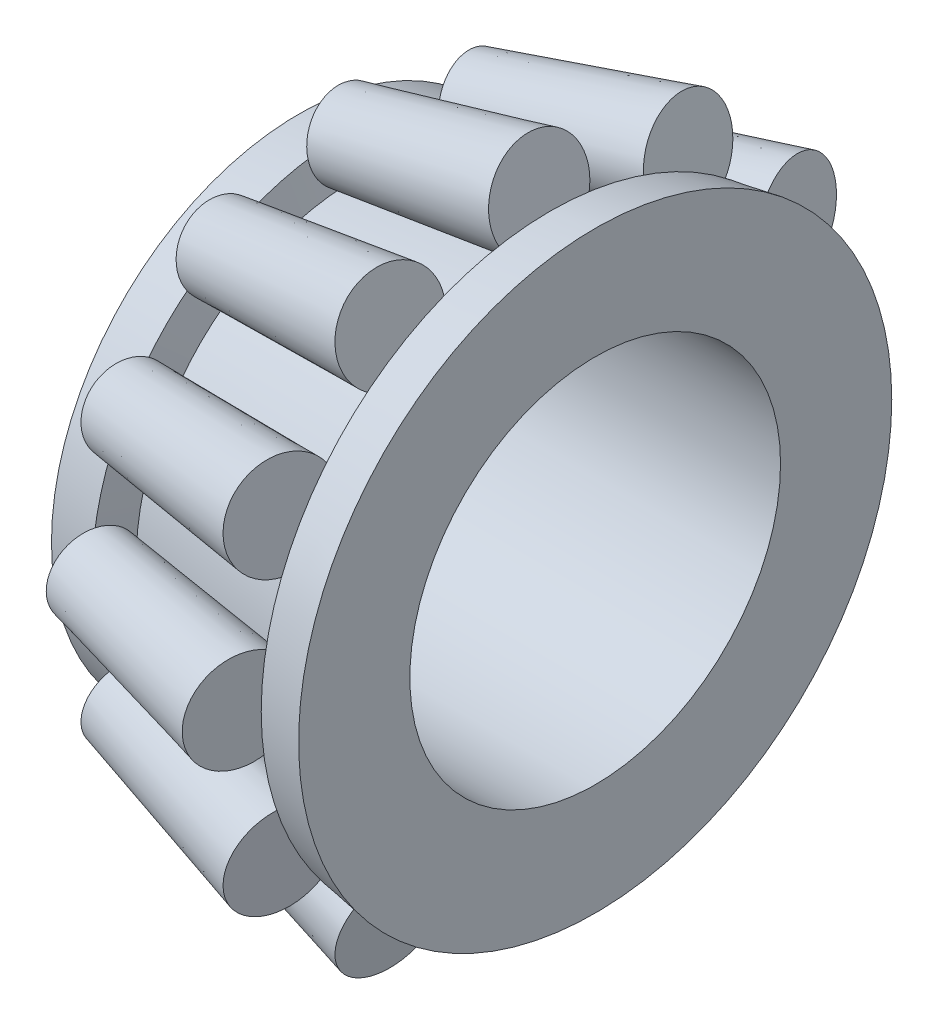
ISO-10303-21;
HEADER;
FILE_DESCRIPTION(('STEP AP214'),'2;1');
FILE_NAME('part.step','',(''),(''),'','','');
FILE_SCHEMA(('AUTOMOTIVE_DESIGN { 1 0 10303 214 1 1 1 1 }'));
ENDSEC;
DATA;
#1=APPLICATION_CONTEXT('core data for automotive mechanical design processes');
#2=APPLICATION_PROTOCOL_DEFINITION('international standard','automotive_design',2000,#1);
#3=PRODUCT_CONTEXT('',#1,'mechanical');
#4=PRODUCT('Part','Part','',(#3));
#5=PRODUCT_RELATED_PRODUCT_CATEGORY('part','',(#4));
#6=PRODUCT_DEFINITION_FORMATION('','',#4);
#7=PRODUCT_DEFINITION_CONTEXT('part definition',#1,'design');
#8=PRODUCT_DEFINITION('design','',#6,#7);
#9=PRODUCT_DEFINITION_SHAPE('','',#8);
#10=(LENGTH_UNIT() NAMED_UNIT(*) SI_UNIT(.MILLI.,.METRE.));
#11=(NAMED_UNIT(*) PLANE_ANGLE_UNIT() SI_UNIT($,.RADIAN.));
#12=(NAMED_UNIT(*) SI_UNIT($,.STERADIAN.) SOLID_ANGLE_UNIT());
#13=UNCERTAINTY_MEASURE_WITH_UNIT(LENGTH_MEASURE(1.E-05),#10,'distance_accuracy_value','');
#14=(GEOMETRIC_REPRESENTATION_CONTEXT(3) GLOBAL_UNCERTAINTY_ASSIGNED_CONTEXT((#13)) GLOBAL_UNIT_ASSIGNED_CONTEXT((#10,
#11,#12)) REPRESENTATION_CONTEXT('',''));
#15=CARTESIAN_POINT('',(0.,0.,0.));
#16=DIRECTION('',(0.,0.,1.));
#17=DIRECTION('',(1.,0.,0.));
#18=AXIS2_PLACEMENT_3D('',#15,#16,#17);
#19=CARTESIAN_POINT('',(-10.0272121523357,0.,0.));
#20=DIRECTION('',(1.,0.,0.));
#21=DIRECTION('',(0.,0.,-1.));
#22=AXIS2_PLACEMENT_3D('',#19,#20,#21);
#23=CONICAL_SURFACE('',#22,10.3287979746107,0.165148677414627);
#24=CARTESIAN_POINT('',(-12.,0.,0.));
#25=DIRECTION('',(1.,0.,0.));
#26=DIRECTION('',(0.,0.,-1.));
#27=AXIS2_PLACEMENT_3D('',#24,#25,#26);
#28=CIRCLE('',#27,10.);
#29=CARTESIAN_POINT('',(-12.,0.,-10.));
#30=VERTEX_POINT('',#29);
#31=EDGE_CURVE('E651',#30,#30,#28,.T.);
#32=ORIENTED_EDGE('',*,*,#31,.T.);
#33=EDGE_LOOP('',(#32));
#34=FACE_BOUND('',#33,.T.);
#35=CARTESIAN_POINT('',(-10.0272121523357,0.,0.));
#36=DIRECTION('',(1.,0.,0.));
#37=DIRECTION('',(0.,0.,-1.));
#38=AXIS2_PLACEMENT_3D('',#35,#36,#37);
#39=CIRCLE('',#38,10.3287979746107);
#40=CARTESIAN_POINT('',(-10.0272121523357,9.5274202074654,-3.9890264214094));
#41=VERTEX_POINT('',#40);
#42=CARTESIAN_POINT('',(-10.0272121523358,10.2455011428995,-1.30911188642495));
#43=VERTEX_POINT('',#42);
#44=EDGE_CURVE('E645',#41,#43,#39,.T.);
#45=ORIENTED_EDGE('',*,*,#44,.F.);
#46=CARTESIAN_POINT('',(-7.57324991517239,-0.356864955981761,0.206036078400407));
#47=DIRECTION('',(0.974500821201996,0.194322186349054,-0.11219196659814));
#48=DIRECTION('',(0.224383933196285,-0.843942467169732,0.487250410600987));
#49=AXIS2_PLACEMENT_3D('',#46,#47,#48);
#50=ELLIPSE('',#49,11.0187610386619,10.7298819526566);
#51=CARTESIAN_POINT('',(-10.0272121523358,8.21830832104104,-6.25647472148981));
#52=VERTEX_POINT('',#51);
#53=EDGE_CURVE('E387',#41,#52,#50,.F.);
#54=ORIENTED_EDGE('',*,*,#53,.T.);
#55=CARTESIAN_POINT('',(-10.0272121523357,6.25647472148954,-8.21830832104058));
#56=VERTEX_POINT('',#55);
#57=EDGE_CURVE('E943',#56,#52,#39,.T.);
#58=ORIENTED_EDGE('',*,*,#57,.F.);
#59=CARTESIAN_POINT('',(-7.57324991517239,-0.206036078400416,0.356864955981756));
#60=DIRECTION('',(0.974500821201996,0.112191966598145,-0.194322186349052));
#61=DIRECTION('',(0.224383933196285,-0.487250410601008,0.84394246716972));
#62=AXIS2_PLACEMENT_3D('',#59,#60,#61);
#63=ELLIPSE('',#62,11.0187610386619,10.7298819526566);
#64=CARTESIAN_POINT('',(-10.0272121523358,3.98902642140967,-9.52742020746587));
#65=VERTEX_POINT('',#64);
#66=EDGE_CURVE('E575',#56,#65,#63,.F.);
#67=ORIENTED_EDGE('',*,*,#66,.T.);
#68=CARTESIAN_POINT('',(-10.0272121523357,1.30911188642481,-10.2455011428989));
#69=VERTEX_POINT('',#68);
#70=EDGE_CURVE('E921',#69,#65,#39,.T.);
#71=ORIENTED_EDGE('',*,*,#70,.F.);
#72=CARTESIAN_POINT('',(-7.57324991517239,0.,0.412072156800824));
#73=DIRECTION('',(0.974500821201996,0.,-0.224383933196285));
#74=DIRECTION('',(0.224383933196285,0.,0.974500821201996));
#75=AXIS2_PLACEMENT_3D('',#72,#73,#74);
#76=ELLIPSE('',#75,11.0187610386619,10.7298819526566);
#77=CARTESIAN_POINT('',(-10.0272121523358,-1.30911188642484,-10.2455011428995));
#78=VERTEX_POINT('',#77);
#79=EDGE_CURVE('E1075',#69,#78,#76,.F.);
#80=ORIENTED_EDGE('',*,*,#79,.T.);
#81=CARTESIAN_POINT('',(-10.0272121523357,-3.98902642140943,-9.52742020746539));
#82=VERTEX_POINT('',#81);
#83=EDGE_CURVE('E944',#82,#78,#39,.T.);
#84=ORIENTED_EDGE('',*,*,#83,.F.);
#85=CARTESIAN_POINT('',(-7.57324991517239,0.206036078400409,0.35686495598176));
#86=DIRECTION('',(0.974500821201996,-0.112191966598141,-0.194322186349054));
#87=DIRECTION('',(0.224383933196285,0.48725041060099,0.84394246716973));
#88=AXIS2_PLACEMENT_3D('',#85,#86,#87);
#89=ELLIPSE('',#88,11.0187610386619,10.7298819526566);
#90=CARTESIAN_POINT('',(-10.0272121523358,-6.25647472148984,-8.21830832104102));
#91=VERTEX_POINT('',#90);
#92=EDGE_CURVE('E1067',#82,#91,#89,.F.);
#93=ORIENTED_EDGE('',*,*,#92,.T.);
#94=CARTESIAN_POINT('',(-10.0272121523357,-8.21830832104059,-6.25647472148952));
#95=VERTEX_POINT('',#94);
#96=EDGE_CURVE('E946',#95,#91,#39,.T.);
#97=ORIENTED_EDGE('',*,*,#96,.F.);
#98=CARTESIAN_POINT('',(-7.57324991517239,0.356864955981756,0.206036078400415));
#99=DIRECTION('',(0.974500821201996,-0.194322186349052,-0.112191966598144));
#100=DIRECTION('',(0.224383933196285,0.843942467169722,0.487250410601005));
#101=AXIS2_PLACEMENT_3D('',#98,#99,#100);
#102=ELLIPSE('',#101,11.0187610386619,10.7298819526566);
#103=CARTESIAN_POINT('',(-10.0272121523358,-9.52742020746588,-3.98902642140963));
#104=VERTEX_POINT('',#103);
#105=EDGE_CURVE('E1055',#95,#104,#102,.F.);
#106=ORIENTED_EDGE('',*,*,#105,.T.);
#107=CARTESIAN_POINT('',(-10.0272121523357,-10.245501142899,-1.30911188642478));
#108=VERTEX_POINT('',#107);
#109=EDGE_CURVE('E952',#108,#104,#39,.T.);
#110=ORIENTED_EDGE('',*,*,#109,.F.);
#111=CARTESIAN_POINT('',(-7.57324991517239,0.412072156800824,0.));
#112=DIRECTION('',(0.974500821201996,-0.224383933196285,0.));
#113=DIRECTION('',(0.224383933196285,0.974500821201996,0.));
#114=AXIS2_PLACEMENT_3D('',#111,#112,#113);
#115=ELLIPSE('',#114,11.0187610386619,10.7298819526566);
#116=CARTESIAN_POINT('',(-10.0272121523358,-10.2455011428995,1.30911188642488));
#117=VERTEX_POINT('',#116);
#118=EDGE_CURVE('E1043',#108,#117,#115,.F.);
#119=ORIENTED_EDGE('',*,*,#118,.T.);
#120=CARTESIAN_POINT('',(-10.0272121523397,-9.52742020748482,3.98902642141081));
#121=VERTEX_POINT('',#120);
#122=EDGE_CURVE('E958',#121,#117,#39,.T.);
#123=ORIENTED_EDGE('',*,*,#122,.F.);
#124=CARTESIAN_POINT('',(-7.57324991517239,0.356864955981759,-0.20603607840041));
#125=DIRECTION('',(0.974500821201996,-0.194322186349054,0.112191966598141));
#126=DIRECTION('',(0.224383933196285,0.843942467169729,-0.487250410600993));
#127=AXIS2_PLACEMENT_3D('',#124,#125,#126);
#128=ELLIPSE('',#127,11.0187610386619,10.7298819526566);
#129=CARTESIAN_POINT('',(-10.0272121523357,-8.21830832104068,6.2564747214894));
#130=VERTEX_POINT('',#129);
#131=EDGE_CURVE('E1031',#121,#130,#128,.F.);
#132=ORIENTED_EDGE('',*,*,#131,.T.);
#133=CARTESIAN_POINT('',(-10.0272121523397,-6.25647472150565,8.2183083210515));
#134=VERTEX_POINT('',#133);
#135=EDGE_CURVE('E964',#134,#130,#39,.T.);
#136=ORIENTED_EDGE('',*,*,#135,.F.);
#137=CARTESIAN_POINT('',(-7.57324991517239,0.206036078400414,-0.356864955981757));
#138=DIRECTION('',(0.974500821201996,-0.112191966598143,0.194322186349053));
#139=DIRECTION('',(0.224383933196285,0.487250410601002,-0.843942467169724));
#140=AXIS2_PLACEMENT_3D('',#137,#138,#139);
#141=ELLIPSE('',#140,11.0187610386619,10.7298819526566);
#142=CARTESIAN_POINT('',(-10.0272121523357,-3.98902642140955,9.52742020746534));
#143=VERTEX_POINT('',#142);
#144=EDGE_CURVE('E1019',#134,#143,#141,.F.);
#145=ORIENTED_EDGE('',*,*,#144,.T.);
#146=CARTESIAN_POINT('',(-10.0272121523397,-1.3091118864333,10.2455011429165));
#147=VERTEX_POINT('',#146);
#148=EDGE_CURVE('E970',#147,#143,#39,.T.);
#149=ORIENTED_EDGE('',*,*,#148,.F.);
#150=CARTESIAN_POINT('',(-7.57324991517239,0.,-0.412072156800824));
#151=DIRECTION('',(0.974500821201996,0.,0.224383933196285));
#152=DIRECTION('',(0.224383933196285,0.,-0.974500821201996));
#153=AXIS2_PLACEMENT_3D('',#150,#151,#152);
#154=ELLIPSE('',#153,11.0187610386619,10.7298819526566);
#155=CARTESIAN_POINT('',(-10.0272121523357,1.30911188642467,10.245501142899));
#156=VERTEX_POINT('',#155);
#157=EDGE_CURVE('E1008',#147,#156,#154,.F.);
#158=ORIENTED_EDGE('',*,*,#157,.T.);
#159=CARTESIAN_POINT('',(-10.0272121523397,3.98902642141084,9.5274202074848));
#160=VERTEX_POINT('',#159);
#161=EDGE_CURVE('E976',#160,#156,#39,.T.);
#162=ORIENTED_EDGE('',*,*,#161,.F.);
#163=CARTESIAN_POINT('',(-7.57324991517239,-0.206036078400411,-0.356864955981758));
#164=DIRECTION('',(0.974500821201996,0.112191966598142,0.194322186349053));
#165=DIRECTION('',(0.224383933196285,-0.487250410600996,-0.843942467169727));
#166=AXIS2_PLACEMENT_3D('',#163,#164,#165);
#167=ELLIPSE('',#166,11.0187610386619,10.7298819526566);
#168=CARTESIAN_POINT('',(-10.0272121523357,6.25647472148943,8.21830832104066));
#169=VERTEX_POINT('',#168);
#170=EDGE_CURVE('E995',#160,#169,#167,.F.);
#171=ORIENTED_EDGE('',*,*,#170,.T.);
#172=CARTESIAN_POINT('',(-10.0272121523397,8.21830832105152,6.25647472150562));
#173=VERTEX_POINT('',#172);
#174=EDGE_CURVE('E652',#173,#169,#39,.T.);
#175=ORIENTED_EDGE('',*,*,#174,.F.);
#176=CARTESIAN_POINT('',(-7.57324991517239,-0.356864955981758,-0.206036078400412));
#177=DIRECTION('',(0.974500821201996,0.194322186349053,0.112191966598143));
#178=DIRECTION('',(0.224383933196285,-0.843942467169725,-0.487250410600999));
#179=AXIS2_PLACEMENT_3D('',#176,#177,#178);
#180=ELLIPSE('',#179,11.0187610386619,10.7298819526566);
#181=CARTESIAN_POINT('',(-10.0272121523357,9.52742020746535,3.98902642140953));
#182=VERTEX_POINT('',#181);
#183=EDGE_CURVE('E994',#173,#182,#180,.F.);
#184=ORIENTED_EDGE('',*,*,#183,.T.);
#185=CARTESIAN_POINT('',(-10.0272121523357,10.245501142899,1.30911188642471));
#186=VERTEX_POINT('',#185);
#187=EDGE_CURVE('E648',#186,#182,#39,.T.);
#188=ORIENTED_EDGE('',*,*,#187,.F.);
#189=CARTESIAN_POINT('',(-7.57324991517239,-0.412072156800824,0.));
#190=DIRECTION('',(0.974500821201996,0.224383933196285,0.));
#191=DIRECTION('',(0.224383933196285,-0.974500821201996,0.));
#192=AXIS2_PLACEMENT_3D('',#189,#190,#191);
#193=ELLIPSE('',#192,11.0187610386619,10.7298819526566);
#194=EDGE_CURVE('E940',#186,#43,#193,.F.);
#195=ORIENTED_EDGE('',*,*,#194,.T.);
#196=EDGE_LOOP('',(#45,#54,#58,#67,#71,#80,#84,#93,#97,#106,#110,#119,#123,#132,#136,#145,#149,
#158,#162,#171,#175,#184,#188,#195));
#197=FACE_BOUND('',#196,.T.);
#198=ADVANCED_FACE('F24',(#34,#197),#23,.T.);
#199=CARTESIAN_POINT('',(-9.70664461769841,0.,0.));
#200=DIRECTION('',(-1.,0.,0.));
#201=DIRECTION('',(0.,0.,1.));
#202=AXIS2_PLACEMENT_3D('',#199,#200,#201);
#203=CONICAL_SURFACE('',#202,8.86153526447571,1.35569632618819);
#204=CARTESIAN_POINT('',(-9.70664461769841,0.,0.));
#205=DIRECTION('',(1.,0.,0.));
#206=DIRECTION('',(0.,0.,-1.));
#207=AXIS2_PLACEMENT_3D('',#204,#205,#206);
#208=CIRCLE('',#207,8.86153526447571);
#209=CARTESIAN_POINT('',(-9.70664461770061,7.85843299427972,-4.09534346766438));
#210=VERTEX_POINT('',#209);
#211=CARTESIAN_POINT('',(-9.70664461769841,8.85327434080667,-0.382545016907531));
#212=VERTEX_POINT('',#211);
#213=EDGE_CURVE('E636',#210,#212,#208,.T.);
#214=ORIENTED_EDGE('',*,*,#213,.F.);
#215=CARTESIAN_POINT('',(-9.70644461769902,7.85712842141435,-4.09586585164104));
#216=CARTESIAN_POINT('',(-9.71927292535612,7.94000951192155,-4.06373843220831));
#217=CARTESIAN_POINT('',(-9.73349885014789,8.02496401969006,-4.04015946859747));
#218=CARTESIAN_POINT('',(-9.76363896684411,8.19651072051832,-4.00482929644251));
#219=CARTESIAN_POINT('',(-9.77954087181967,8.28308762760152,-3.99299783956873));
#220=CARTESIAN_POINT('',(-9.82814493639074,8.54181185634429,-3.96704984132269));
#221=CARTESIAN_POINT('',(-9.86199825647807,8.71443031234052,-3.96211626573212));
#222=CARTESIAN_POINT('',(-9.91784448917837,8.99361780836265,-3.9636304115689));
#223=CARTESIAN_POINT('',(-9.9394574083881,9.10036643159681,-3.96646645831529));
#224=CARTESIAN_POINT('',(-9.98314684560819,9.31423740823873,-3.97551805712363));
#225=CARTESIAN_POINT('',(-10.0052252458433,9.42135863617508,-3.98175190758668));
#226=CARTESIAN_POINT('',(-10.0274121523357,9.52838473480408,-3.98909301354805));
#227=B_SPLINE_CURVE_WITH_KNOTS('',3,(#215,#216,#217,#218,#219,#220,#221,#222,#223,#224,#225,
#226),.UNSPECIFIED.,.F.,.F.,(4,2,2,2,2,4),(0.,0.267654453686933,0.533467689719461,
1.06053221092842,1.38736814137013,1.71598184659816),.UNSPECIFIED.);
#228=EDGE_CURVE('E381',#210,#41,#227,.T.);
#229=ORIENTED_EDGE('',*,*,#228,.T.);
#230=ORIENTED_EDGE('',*,*,#44,.T.);
#231=CARTESIAN_POINT('',(-10.0274121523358,10.2463697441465,-1.3095364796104));
#232=CARTESIAN_POINT('',(-10.0053403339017,10.1505116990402,-1.26257514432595));
#233=CARTESIAN_POINT('',(-9.9833606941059,10.0550539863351,-1.21466001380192));
#234=CARTESIAN_POINT('',(-9.93965152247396,9.86522478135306,-1.11560699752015));
#235=CARTESIAN_POINT('',(-9.91792349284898,9.77085981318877,-1.06445601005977));
#236=CARTESIAN_POINT('',(-9.87545768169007,9.58643053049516,-0.959194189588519));
#237=CARTESIAN_POINT('',(-9.854708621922,9.49631723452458,-0.905175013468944));
#238=CARTESIAN_POINT('',(-9.81406360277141,9.31979566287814,-0.791303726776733));
#239=CARTESIAN_POINT('',(-9.79416623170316,9.23338125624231,-0.731461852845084));
#240=CARTESIAN_POINT('',(-9.76258447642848,9.09622149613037,-0.624851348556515));
#241=CARTESIAN_POINT('',(-9.75045589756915,9.04354700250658,-0.58080196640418));
#242=CARTESIAN_POINT('',(-9.72737840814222,8.94332132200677,-0.48636691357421));
#243=CARTESIAN_POINT('',(-9.71643819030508,8.89580788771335,-0.435939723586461));
#244=CARTESIAN_POINT('',(-9.70644461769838,8.85240573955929,-0.381440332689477));
#245=B_SPLINE_CURVE_WITH_KNOTS('',3,(#231,#232,#233,#234,#235,#236,#237,#238,#239,#240,#241,
#242,#243,#244),.UNSPECIFIED.,.F.,.F.,(4,2,2,2,2,2,4),(0.,0.327060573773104,0.655542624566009,
0.976686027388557,1.29727470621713,1.50605606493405,1.71627422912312),.UNSPECIFIED.);
#246=EDGE_CURVE('E400',#43,#212,#245,.T.);
#247=ORIENTED_EDGE('',*,*,#246,.T.);
#248=EDGE_LOOP('',(#214,#229,#230,#247));
#249=FACE_BOUND('',#248,.T.);
#250=ADVANCED_FACE('F396',(#249),#203,.T.);
#251=ORIENTED_EDGE('',*,*,#57,.T.);
#252=CARTESIAN_POINT('',(-10.0274121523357,8.21884825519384,-6.25727673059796));
#253=CARTESIAN_POINT('',(-10.0053403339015,8.15931342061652,-6.16867799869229));
#254=CARTESIAN_POINT('',(-9.98336069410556,8.10060218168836,-6.07945342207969));
#255=CARTESIAN_POINT('',(-9.93965152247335,7.98573177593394,-5.89875639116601));
#256=CARTESIAN_POINT('',(-9.91792349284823,7.92958481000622,-5.80727585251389));
#257=CARTESIAN_POINT('',(-9.87545768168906,7.82249527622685,-5.62390180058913));
#258=CARTESIAN_POINT('',(-9.85470862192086,7.77146446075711,-5.53206317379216));
#259=CARTESIAN_POINT('',(-9.81406360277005,7.67552793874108,-5.34518696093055));
#260=CARTESIAN_POINT('',(-9.7941662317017,7.63061180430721,-5.25015517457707));
#261=CARTESIAN_POINT('',(-9.76258447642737,7.56513321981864,-5.08924788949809));
#262=CARTESIAN_POINT('',(-9.75045589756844,7.54154046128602,-5.02476275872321));
#263=CARTESIAN_POINT('',(-9.72737840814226,7.50196000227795,-4.8928667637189));
#264=CARTESIAN_POINT('',(-9.71643819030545,7.48602575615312,-4.82543881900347));
#265=CARTESIAN_POINT('',(-9.70644461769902,7.47568808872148,-4.7565398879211));
#266=B_SPLINE_CURVE_WITH_KNOTS('',3,(#252,#253,#254,#255,#256,#257,#258,#259,#260,#261,#262,
#263,#264,#265),.UNSPECIFIED.,.F.,.F.,(4,2,2,2,2,2,4),(0.,0.327060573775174,0.655542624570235,
0.976686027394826,1.2972747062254,1.50605606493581,1.7162742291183),.UNSPECIFIED.);
#267=CARTESIAN_POINT('',(-9.70664461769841,7.47588797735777,-4.75793087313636));
#268=VERTEX_POINT('',#267);
#269=EDGE_CURVE('E374',#52,#268,#266,.T.);
#270=ORIENTED_EDGE('',*,*,#269,.T.);
#271=CARTESIAN_POINT('',(-9.70664461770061,4.75793087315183,-7.47588797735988));
#272=VERTEX_POINT('',#271);
#273=EDGE_CURVE('E627',#272,#268,#208,.T.);
#274=ORIENTED_EDGE('',*,*,#273,.F.);
#275=CARTESIAN_POINT('',(-9.7064446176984,4.75653988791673,-7.4756880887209));
#276=CARTESIAN_POINT('',(-9.71927292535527,4.84438072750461,-7.48930547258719));
#277=CARTESIAN_POINT('',(-9.7334988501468,4.92974297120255,-7.51136274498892));
#278=CARTESIAN_POINT('',(-9.76363896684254,5.09597185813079,-7.56653926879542));
#279=CARTESIAN_POINT('',(-9.77954087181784,5.17686538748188,-7.59958138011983));
#280=CARTESIAN_POINT('',(-9.82814493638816,5.41390114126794,-7.70647186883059));
#281=CARTESIAN_POINT('',(-9.86199825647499,5.56585989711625,-7.7885084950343));
#282=CARTESIAN_POINT('',(-9.91784448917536,5.80688628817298,-7.92941353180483));
#283=CARTESIAN_POINT('',(-9.93945740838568,5.89791528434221,-7.98524393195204));
#284=CARTESIAN_POINT('',(-9.98314684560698,6.0786071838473,-8.10001833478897));
#285=CARTESIAN_POINT('',(-10.0052252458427,6.16825996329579,-8.15897762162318));
#286=CARTESIAN_POINT('',(-10.0274121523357,6.25727673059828,-8.21884825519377));
#287=B_SPLINE_CURVE_WITH_KNOTS('',3,(#275,#276,#277,#278,#279,#280,#281,#282,#283,#284,#285,
#286),.UNSPECIFIED.,.F.,.F.,(4,2,2,2,2,4),(0.,0.267654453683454,0.533467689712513,
1.06053221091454,1.38736814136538,1.71598184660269),.UNSPECIFIED.);
#288=EDGE_CURVE('E568',#272,#56,#287,.T.);
#289=ORIENTED_EDGE('',*,*,#288,.T.);
#290=EDGE_LOOP('',(#251,#270,#274,#289));
#291=FACE_BOUND('',#290,.T.);
#292=ADVANCED_FACE('F633',(#291),#203,.T.);
#293=CARTESIAN_POINT('',(-1.81549322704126,0.,0.));
#294=DIRECTION('',(1.,0.,0.));
#295=DIRECTION('',(0.,0.,-1.));
#296=AXIS2_PLACEMENT_3D('',#293,#294,#295);
#297=CONICAL_SURFACE('',#296,10.1767271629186,0.165148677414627);
#298=CARTESIAN_POINT('',(-1.81549322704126,0.,0.));
#299=DIRECTION('',(1.,0.,0.));
#300=DIRECTION('',(0.,0.,-1.));
#301=AXIS2_PLACEMENT_3D('',#298,#299,#300);
#302=CIRCLE('',#301,10.1767271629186);
#303=CARTESIAN_POINT('',(-1.81549322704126,0.,-10.1767271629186));
#304=VERTEX_POINT('',#303);
#305=EDGE_CURVE('E640',#304,#304,#302,.T.);
#306=ORIENTED_EDGE('',*,*,#305,.F.);
#307=EDGE_LOOP('',(#306));
#308=FACE_BOUND('',#307,.T.);
#309=CARTESIAN_POINT('',(-1.81529322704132,9.05273417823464,-4.64913519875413));
#310=CARTESIAN_POINT('',(-2.44140239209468,8.97110154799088,-4.57965880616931));
#311=CARTESIAN_POINT('',(-3.06757417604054,8.88842503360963,-4.5120169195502));
#312=CARTESIAN_POINT('',(-4.31999763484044,8.72137013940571,-4.37976124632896));
#313=CARTESIAN_POINT('',(-4.94624930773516,8.63699179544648,-4.31514739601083));
#314=CARTESIAN_POINT('',(-6.26151356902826,8.45840212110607,-4.18195457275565));
#315=CARTESIAN_POINT('',(-6.95053256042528,8.36405208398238,-4.11362625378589));
#316=CARTESIAN_POINT('',(-8.32864275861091,8.17399027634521,-3.97946927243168));
#317=CARTESIAN_POINT('',(-9.01773396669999,8.07827847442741,-3.91364066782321));
#318=CARTESIAN_POINT('',(-9.7068446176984,7.98200553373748,-3.84887050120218));
#319=B_SPLINE_CURVE_WITH_KNOTS('',3,(#309,#310,#311,#312,#313,#314,#315,#316,#317,#318),
.UNSPECIFIED.,.F.,.F.,(4,2,2,2,4),(0.,1.90564744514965,3.81125477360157,5.9076412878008,
8.00407622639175),.UNSPECIFIED.);
#320=CARTESIAN_POINT('',(-1.82977519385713,9.05084683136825,-4.647526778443));
#321=VERTEX_POINT('',#320);
#322=CARTESIAN_POINT('',(-9.70305650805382,7.98253482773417,-3.84922642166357));
#323=VERTEX_POINT('',#322);
#324=EDGE_CURVE('E28',#321,#323,#319,.T.);
#325=ORIENTED_EDGE('',*,*,#324,.T.);
#326=CARTESIAN_POINT('',(-7.58670693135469,-0.306251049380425,0.176814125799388));
#327=DIRECTION('',(0.974500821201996,0.194322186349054,-0.11219196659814));
#328=DIRECTION('',(0.224383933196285,-0.843942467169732,0.487250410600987));
#329=AXIS2_PLACEMENT_3D('',#326,#327,#328);
#330=ELLIPSE('',#329,9.45597788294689,9.20807031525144);
#331=EDGE_CURVE('E11',#323,#210,#330,.F.);
#332=ORIENTED_EDGE('',*,*,#331,.T.);
#333=ORIENTED_EDGE('',*,*,#213,.T.);
#334=CARTESIAN_POINT('',(-7.58670693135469,-0.353628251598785,0.));
#335=DIRECTION('',(0.974500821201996,0.224383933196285,0.));
#336=DIRECTION('',(0.224383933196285,-0.974500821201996,0.));
#337=AXIS2_PLACEMENT_3D('',#334,#335,#336);
#338=ELLIPSE('',#337,9.4559778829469,9.20807031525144);
#339=CARTESIAN_POINT('',(-9.70305650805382,8.83769115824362,-0.657739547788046));
#340=VERTEX_POINT('',#339);
#341=EDGE_CURVE('E665',#212,#340,#338,.F.);
#342=ORIENTED_EDGE('',*,*,#341,.T.);
#343=CARTESIAN_POINT('',(-9.7068446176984,8.83705481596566,-0.657783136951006));
#344=CARTESIAN_POINT('',(-9.20548679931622,8.92127499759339,-0.6520098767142));
#345=CARTESIAN_POINT('',(-8.70414042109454,9.00551805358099,-0.645584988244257));
#346=CARTESIAN_POINT('',(-7.70148303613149,9.17404354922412,-0.631288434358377));
#347=CARTESIAN_POINT('',(-7.20017202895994,9.25832598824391,-0.623416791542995));
#348=CARTESIAN_POINT('',(-5.88483556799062,9.47951955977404,-0.600675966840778));
#349=CARTESIAN_POINT('',(-5.07083646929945,9.61645987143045,-0.584505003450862));
#350=CARTESIAN_POINT('',(-3.84992905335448,9.82192500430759,-0.556249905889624));
#351=CARTESIAN_POINT('',(-3.44296990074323,9.89042337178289,-0.54616494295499));
#352=CARTESIAN_POINT('',(-2.62909545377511,10.0274345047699,-0.524396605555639));
#353=CARTESIAN_POINT('',(-2.22218015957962,10.0959472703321,-0.512713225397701));
#354=CARTESIAN_POINT('',(-1.81529322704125,10.164465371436,-0.500097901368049));
#355=B_SPLINE_CURVE_WITH_KNOTS('',3,(#343,#344,#345,#346,#347,#348,#349,#350,#351,#352,#353,
#354),.UNSPECIFIED.,.F.,.F.,(4,2,2,2,2,4),(0.,1.52524481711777,3.05046580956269,
5.52723796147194,6.76565580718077,8.00407806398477),.UNSPECIFIED.);
#356=CARTESIAN_POINT('',(-1.82977519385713,10.1620266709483,-0.500547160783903));
#357=VERTEX_POINT('',#356);
#358=EDGE_CURVE('E658',#340,#357,#355,.T.);
#359=ORIENTED_EDGE('',*,*,#358,.T.);
#360=CARTESIAN_POINT('',(0.603571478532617,-0.406013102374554,0.));
#361=DIRECTION('',(-0.974500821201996,-0.224383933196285,0.));
#362=DIRECTION('',(0.224383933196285,-0.974500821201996,0.));
#363=AXIS2_PLACEMENT_3D('',#360,#361,#362);
#364=ELLIPSE('',#363,10.8567426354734,10.5721111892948);
#365=CARTESIAN_POINT('',(-1.82977519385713,10.1620266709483,0.500547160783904));
#366=VERTEX_POINT('',#365);
#367=EDGE_CURVE('E685',#357,#366,#364,.F.);
#368=ORIENTED_EDGE('',*,*,#367,.T.);
#369=CARTESIAN_POINT('',(-1.81529322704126,10.1644653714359,0.500097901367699));
#370=CARTESIAN_POINT('',(-2.44140239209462,10.0590312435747,0.519449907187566));
#371=CARTESIAN_POINT('',(-3.06757417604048,9.95361033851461,0.536691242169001));
#372=CARTESIAN_POINT('',(-4.31999763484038,9.74280871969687,0.567700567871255));
#373=CARTESIAN_POINT('',(-4.94624930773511,9.63742800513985,0.581468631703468));
#374=CARTESIAN_POINT('',(-6.26151356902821,9.41616839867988,0.607522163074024));
#375=CARTESIAN_POINT('',(-6.95053256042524,9.30029471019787,0.619521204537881));
#376=CARTESIAN_POINT('',(-8.3286427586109,9.06861786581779,0.640673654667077));
#377=CARTESIAN_POINT('',(-9.01773396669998,8.95281471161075,0.649826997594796));
#378=CARTESIAN_POINT('',(-9.7068446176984,8.83705481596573,0.657783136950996));
#379=B_SPLINE_CURVE_WITH_KNOTS('',3,(#369,#370,#371,#372,#373,#374,#375,#376,#377,#378),
.UNSPECIFIED.,.F.,.F.,(4,2,2,2,4),(0.,1.90564744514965,3.81125477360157,5.90764128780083,
8.0040762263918),.UNSPECIFIED.);
#380=CARTESIAN_POINT('',(-9.70305650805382,8.83769115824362,0.657739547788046));
#381=VERTEX_POINT('',#380);
#382=EDGE_CURVE('E678',#366,#381,#379,.T.);
#383=ORIENTED_EDGE('',*,*,#382,.T.);
#384=CARTESIAN_POINT('',(-9.70664461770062,8.8532743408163,0.382545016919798));
#385=VERTEX_POINT('',#384);
#386=EDGE_CURVE('E684',#381,#385,#338,.F.);
#387=ORIENTED_EDGE('',*,*,#386,.T.);
#388=CARTESIAN_POINT('',(-9.70664461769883,7.85843299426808,4.09534346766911));
#389=VERTEX_POINT('',#388);
#390=EDGE_CURVE('E641',#385,#389,#208,.T.);
#391=ORIENTED_EDGE('',*,*,#390,.T.);
#392=CARTESIAN_POINT('',(-7.58670693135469,-0.306251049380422,-0.176814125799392));
#393=DIRECTION('',(0.974500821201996,0.194322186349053,0.112191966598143));
#394=DIRECTION('',(0.224383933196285,-0.843942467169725,-0.487250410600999));
#395=AXIS2_PLACEMENT_3D('',#392,#393,#394);
#396=ELLIPSE('',#395,9.4559778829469,9.20807031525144);
#397=CARTESIAN_POINT('',(-9.70305650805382,7.98253482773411,3.84922642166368));
#398=VERTEX_POINT('',#397);
#399=EDGE_CURVE('E693',#389,#398,#396,.F.);
#400=ORIENTED_EDGE('',*,*,#399,.T.);
#401=CARTESIAN_POINT('',(-9.7068446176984,7.98200553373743,3.84887050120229));
#402=CARTESIAN_POINT('',(-9.20548679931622,8.05205572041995,3.89598038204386));
#403=CARTESIAN_POINT('',(-8.70414042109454,8.12179990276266,3.94366602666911));
#404=CARTESIAN_POINT('',(-7.70148303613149,8.26059898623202,4.04030995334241));
#405=CARTESIAN_POINT('',(-7.20017202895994,8.32965389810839,4.08926821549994));
#406=CARTESIAN_POINT('',(-5.88483556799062,8.50984273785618,4.21955913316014));
#407=CARTESIAN_POINT('',(-5.07083646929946,8.62035104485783,4.30203375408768));
#408=CARTESIAN_POINT('',(-3.84992905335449,8.78416152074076,4.42923595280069));
#409=CARTESIAN_POINT('',(-3.44296990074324,8.83844036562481,4.47221897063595));
#410=CARTESIAN_POINT('',(-2.62909545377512,8.9462113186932,4.55957647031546));
#411=CARTESIAN_POINT('',(-2.22218015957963,8.99970342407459,4.60395095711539));
#412=CARTESIAN_POINT('',(-1.81529322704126,9.0527341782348,4.64913519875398));
#413=B_SPLINE_CURVE_WITH_KNOTS('',3,(#401,#402,#403,#404,#405,#406,#407,#408,#409,#410,#411,
#412),.UNSPECIFIED.,.F.,.F.,(4,2,2,2,2,4),(0.,1.52524481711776,3.05046580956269,
5.52723796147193,6.76565580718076,8.00407806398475),.UNSPECIFIED.);
#414=CARTESIAN_POINT('',(-1.82977519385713,9.05084683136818,4.64752677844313));
#415=VERTEX_POINT('',#414);
#416=EDGE_CURVE('E686',#398,#415,#413,.T.);
#417=ORIENTED_EDGE('',*,*,#416,.T.);
#418=CARTESIAN_POINT('',(0.603571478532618,-0.351617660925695,-0.203006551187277));
#419=DIRECTION('',(-0.974500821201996,-0.194322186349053,-0.112191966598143));
#420=DIRECTION('',(0.224383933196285,-0.843942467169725,-0.487250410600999));
#421=AXIS2_PLACEMENT_3D('',#418,#419,#420);
#422=ELLIPSE('',#421,10.8567426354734,10.5721111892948);
#423=CARTESIAN_POINT('',(-1.82977519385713,8.55029967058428,5.51449989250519));
#424=VERTEX_POINT('',#423);
#425=EDGE_CURVE('E712',#415,#424,#422,.F.);
#426=ORIENTED_EDGE('',*,*,#425,.T.);
#427=CARTESIAN_POINT('',(-1.81529322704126,8.55263627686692,5.5153301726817));
#428=CARTESIAN_POINT('',(-2.44140239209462,8.45165164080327,5.47937243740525));
#429=CARTESIAN_POINT('',(-3.06757417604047,8.35173379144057,5.44159341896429));
#430=CARTESIAN_POINT('',(-4.31999763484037,8.1536695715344,5.3630474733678));
#431=CARTESIAN_POINT('',(-4.9462493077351,8.05552316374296,5.32228060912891));
#432=CARTESIAN_POINT('',(-6.26151356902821,7.85087995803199,5.23421382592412));
#433=CARTESIAN_POINT('',(-6.95053256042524,7.74453087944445,5.18666845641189));
#434=CARTESIAN_POINT('',(-8.3286427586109,7.53331662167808,5.08914859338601));
#435=CARTESIAN_POINT('',(-9.01773396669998,7.42845147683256,5.03917404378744));
#436=CARTESIAN_POINT('',(-9.7068446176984,7.32422239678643,4.98818431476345));
#437=B_SPLINE_CURVE_WITH_KNOTS('',3,(#427,#428,#429,#430,#431,#432,#433,#434,#435,#436),
.UNSPECIFIED.,.F.,.F.,(4,2,2,2,4),(0.,1.90564744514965,3.81125477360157,5.90764128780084,
8.00407622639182),.UNSPECIFIED.);
#438=CARTESIAN_POINT('',(-9.70305650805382,7.32479527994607,4.98846473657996));
#439=VERTEX_POINT('',#438);
#440=EDGE_CURVE('E705',#424,#439,#437,.T.);
#441=ORIENTED_EDGE('',*,*,#440,.T.);
#442=CARTESIAN_POINT('',(-9.70664461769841,7.47588797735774,4.75793087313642));
#443=VERTEX_POINT('',#442);
#444=EDGE_CURVE('E711',#439,#443,#396,.F.);
#445=ORIENTED_EDGE('',*,*,#444,.T.);
#446=CARTESIAN_POINT('',(-9.70664461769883,4.7579308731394,7.47588797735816));
#447=VERTEX_POINT('',#446);
#448=EDGE_CURVE('E646',#443,#447,#208,.T.);
#449=ORIENTED_EDGE('',*,*,#448,.T.);
#450=CARTESIAN_POINT('',(-7.58670693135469,-0.176814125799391,-0.306251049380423));
#451=DIRECTION('',(0.974500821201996,0.112191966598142,0.194322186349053));
#452=DIRECTION('',(0.224383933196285,-0.487250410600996,-0.843942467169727));
#453=AXIS2_PLACEMENT_3D('',#450,#451,#452);
#454=ELLIPSE('',#453,9.4559778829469,9.20807031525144);
#455=CARTESIAN_POINT('',(-9.70305650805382,4.98846473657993,7.32479527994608));
#456=VERTEX_POINT('',#455);
#457=EDGE_CURVE('E720',#447,#456,#454,.F.);
#458=ORIENTED_EDGE('',*,*,#457,.T.);
#459=CARTESIAN_POINT('',(-9.7068446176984,4.98818431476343,7.32422239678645));
#460=CARTESIAN_POINT('',(-9.20548679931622,5.02529461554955,7.40004584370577));
#461=CARTESIAN_POINT('',(-8.70414042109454,5.06185202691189,7.47621491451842));
#462=CARTESIAN_POINT('',(-7.70148303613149,5.1337335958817,7.62931055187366));
#463=CARTESIAN_POINT('',(-7.20017202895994,5.16905777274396,7.70623710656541));
#464=CARTESIAN_POINT('',(-5.88483556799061,5.2599604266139,7.90916677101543));
#465=CARTESIAN_POINT('',(-5.07083646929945,5.31442611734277,8.03584604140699));
#466=CARTESIAN_POINT('',(-3.84992905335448,5.3926890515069,8.22791161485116));
#467=CARTESIAN_POINT('',(-3.44296990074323,5.41820440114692,8.29227542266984));
#468=CARTESIAN_POINT('',(-2.62909545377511,5.46785803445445,8.42181471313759));
#469=CARTESIAN_POINT('',(-2.22218015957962,5.49199631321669,8.48699019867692));
#470=CARTESIAN_POINT('',(-1.81529322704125,5.51533017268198,8.55263627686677));
#471=B_SPLINE_CURVE_WITH_KNOTS('',3,(#459,#460,#461,#462,#463,#464,#465,#466,#467,#468,#469,
#470),.UNSPECIFIED.,.F.,.F.,(4,2,2,2,2,4),(0.,1.52524481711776,3.05046580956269,
5.52723796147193,6.76565580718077,8.00407806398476),.UNSPECIFIED.);
#472=CARTESIAN_POINT('',(-1.82977519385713,5.51449989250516,8.5502996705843));
#473=VERTEX_POINT('',#472);
#474=EDGE_CURVE('E713',#456,#473,#471,.T.);
#475=ORIENTED_EDGE('',*,*,#474,.T.);
#476=CARTESIAN_POINT('',(0.603571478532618,-0.203006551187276,-0.351617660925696));
#477=DIRECTION('',(-0.974500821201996,-0.112191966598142,-0.194322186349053));
#478=DIRECTION('',(0.224383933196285,-0.487250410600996,-0.843942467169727));
#479=AXIS2_PLACEMENT_3D('',#476,#477,#478);
#480=ELLIPSE('',#479,10.8567426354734,10.5721111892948);
#481=CARTESIAN_POINT('',(-1.82977519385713,4.6475267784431,9.0508468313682));
#482=VERTEX_POINT('',#481);
#483=EDGE_CURVE('E739',#473,#482,#480,.F.);
#484=ORIENTED_EDGE('',*,*,#483,.T.);
#485=CARTESIAN_POINT('',(-1.81529322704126,4.64913519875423,9.0527341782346));
#486=CARTESIAN_POINT('',(-2.44140239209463,4.57965880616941,8.97110154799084));
#487=CARTESIAN_POINT('',(-3.06757417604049,4.5120169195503,8.88842503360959));
#488=CARTESIAN_POINT('',(-4.31999763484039,4.37976124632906,8.72137013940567));
#489=CARTESIAN_POINT('',(-4.94624930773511,4.31514739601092,8.63699179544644));
#490=CARTESIAN_POINT('',(-6.26151356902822,4.18195457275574,8.45840212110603));
#491=CARTESIAN_POINT('',(-6.95053256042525,4.11362625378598,8.36405208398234));
#492=CARTESIAN_POINT('',(-8.3286427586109,3.97946927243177,8.17399027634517));
#493=CARTESIAN_POINT('',(-9.01773396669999,3.9136406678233,8.07827847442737));
#494=CARTESIAN_POINT('',(-9.7068446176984,3.84887050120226,7.98200553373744));
#495=B_SPLINE_CURVE_WITH_KNOTS('',3,(#485,#486,#487,#488,#489,#490,#491,#492,#493,#494),
.UNSPECIFIED.,.F.,.F.,(4,2,2,2,4),(0.,1.90564744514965,3.81125477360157,5.90764128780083,
8.0040762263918),.UNSPECIFIED.);
#496=CARTESIAN_POINT('',(-9.70305650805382,3.84922642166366,7.98253482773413));
#497=VERTEX_POINT('',#496);
#498=EDGE_CURVE('E732',#482,#497,#495,.T.);
#499=ORIENTED_EDGE('',*,*,#498,.T.);
#500=CARTESIAN_POINT('',(-9.70664461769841,4.09534346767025,7.85843299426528));
#501=VERTEX_POINT('',#500);
#502=EDGE_CURVE('E738',#497,#501,#454,.F.);
#503=ORIENTED_EDGE('',*,*,#502,.T.);
#504=CARTESIAN_POINT('',(-9.70664461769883,0.382545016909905,8.85327434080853));
#505=VERTEX_POINT('',#504);
#506=EDGE_CURVE('E1366',#501,#505,#208,.T.);
#507=ORIENTED_EDGE('',*,*,#506,.T.);
#508=CARTESIAN_POINT('',(-7.58670693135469,0.,-0.353628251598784));
#509=DIRECTION('',(0.974500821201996,0.,0.224383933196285));
#510=DIRECTION('',(0.224383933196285,0.,-0.974500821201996));
#511=AXIS2_PLACEMENT_3D('',#508,#509,#510);
#512=ELLIPSE('',#511,9.4559778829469,9.20807031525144);
#513=CARTESIAN_POINT('',(-9.70305650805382,0.657739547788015,8.83769115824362));
#514=VERTEX_POINT('',#513);
#515=EDGE_CURVE('E747',#505,#514,#512,.F.);
#516=ORIENTED_EDGE('',*,*,#515,.T.);
#517=CARTESIAN_POINT('',(-9.7068446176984,0.657783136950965,8.83705481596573));
#518=CARTESIAN_POINT('',(-9.20548679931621,0.652009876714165,8.92127499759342));
#519=CARTESIAN_POINT('',(-8.70414042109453,0.645584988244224,9.005518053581));
#520=CARTESIAN_POINT('',(-7.70148303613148,0.631288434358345,9.17404354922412));
#521=CARTESIAN_POINT('',(-7.20017202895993,0.623416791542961,9.25832598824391));
#522=CARTESIAN_POINT('',(-5.88483556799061,0.600675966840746,9.47951955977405));
#523=CARTESIAN_POINT('',(-5.07083646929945,0.584505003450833,9.61645987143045));
#524=CARTESIAN_POINT('',(-3.84992905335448,0.556249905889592,9.8219250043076));
#525=CARTESIAN_POINT('',(-3.44296990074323,0.546164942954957,9.89042337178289));
#526=CARTESIAN_POINT('',(-2.62909545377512,0.524396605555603,10.0274345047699));
#527=CARTESIAN_POINT('',(-2.22218015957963,0.512713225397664,10.0959472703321));
#528=CARTESIAN_POINT('',(-1.81529322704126,0.500097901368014,10.164465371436));
#529=B_SPLINE_CURVE_WITH_KNOTS('',3,(#517,#518,#519,#520,#521,#522,#523,#524,#525,#526,#527,
#528),.UNSPECIFIED.,.F.,.F.,(4,2,2,2,2,4),(0.,1.52524481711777,3.05046580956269,
5.52723796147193,6.76565580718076,8.00407806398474),.UNSPECIFIED.);
#530=CARTESIAN_POINT('',(-1.82977519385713,0.500547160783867,10.1620266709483));
#531=VERTEX_POINT('',#530);
#532=EDGE_CURVE('E740',#514,#531,#529,.T.);
#533=ORIENTED_EDGE('',*,*,#532,.T.);
#534=CARTESIAN_POINT('',(0.603571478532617,0.,-0.406013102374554));
#535=DIRECTION('',(-0.974500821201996,0.,-0.224383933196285));
#536=DIRECTION('',(0.224383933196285,0.,-0.974500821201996));
#537=AXIS2_PLACEMENT_3D('',#534,#535,#536);
#538=ELLIPSE('',#537,10.8567426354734,10.5721111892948);
#539=CARTESIAN_POINT('',(-1.82977519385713,-0.500547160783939,10.1620266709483));
#540=VERTEX_POINT('',#539);
#541=EDGE_CURVE('E766',#531,#540,#538,.F.);
#542=ORIENTED_EDGE('',*,*,#541,.T.);
#543=CARTESIAN_POINT('',(-1.81529322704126,-0.500097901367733,10.164465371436));
#544=CARTESIAN_POINT('',(-2.44140239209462,-0.5194499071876,10.0590312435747));
#545=CARTESIAN_POINT('',(-3.06757417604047,-0.536691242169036,9.95361033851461));
#546=CARTESIAN_POINT('',(-4.31999763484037,-0.56770056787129,9.74280871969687));
#547=CARTESIAN_POINT('',(-4.9462493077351,-0.581468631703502,9.63742800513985));
#548=CARTESIAN_POINT('',(-6.26151356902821,-0.607522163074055,9.41616839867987));
#549=CARTESIAN_POINT('',(-6.95053256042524,-0.61952120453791,9.30029471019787));
#550=CARTESIAN_POINT('',(-8.3286427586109,-0.640673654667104,9.06861786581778));
#551=CARTESIAN_POINT('',(-9.01773396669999,-0.649826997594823,8.95281471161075));
#552=CARTESIAN_POINT('',(-9.70684461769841,-0.657783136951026,8.83705481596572));
#553=B_SPLINE_CURVE_WITH_KNOTS('',3,(#543,#544,#545,#546,#547,#548,#549,#550,#551,#552),
.UNSPECIFIED.,.F.,.F.,(4,2,2,2,4),(0.,1.90564744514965,3.81125477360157,5.90764128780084,
8.00407622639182),.UNSPECIFIED.);
#554=CARTESIAN_POINT('',(-9.70305650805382,-0.657739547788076,8.83769115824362));
#555=VERTEX_POINT('',#554);
#556=EDGE_CURVE('E759',#540,#555,#553,.T.);
#557=ORIENTED_EDGE('',*,*,#556,.T.);
#558=CARTESIAN_POINT('',(-9.70664461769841,-0.382545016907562,8.85327434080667));
#559=VERTEX_POINT('',#558);
#560=EDGE_CURVE('E765',#555,#559,#512,.F.);
#561=ORIENTED_EDGE('',*,*,#560,.T.);
#562=CARTESIAN_POINT('',(-9.70664461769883,-4.09534346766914,7.85843299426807));
#563=VERTEX_POINT('',#562);
#564=EDGE_CURVE('E1367',#559,#563,#208,.T.);
#565=ORIENTED_EDGE('',*,*,#564,.T.);
#566=CARTESIAN_POINT('',(-7.58670693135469,0.176814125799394,-0.306251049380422));
#567=DIRECTION('',(0.974500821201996,-0.112191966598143,0.194322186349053));
#568=DIRECTION('',(0.224383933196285,0.487250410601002,-0.843942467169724));
#569=AXIS2_PLACEMENT_3D('',#566,#567,#568);
#570=ELLIPSE('',#569,9.4559778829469,9.20807031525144);
#571=CARTESIAN_POINT('',(-9.70305650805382,-3.84922642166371,7.9825348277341));
#572=VERTEX_POINT('',#571);
#573=EDGE_CURVE('E774',#563,#572,#570,.F.);
#574=ORIENTED_EDGE('',*,*,#573,.T.);
#575=CARTESIAN_POINT('',(-9.7068446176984,-3.84887050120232,7.98200553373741));
#576=CARTESIAN_POINT('',(-9.20548679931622,-3.89598038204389,8.05205572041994));
#577=CARTESIAN_POINT('',(-8.70414042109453,-3.94366602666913,8.12179990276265));
#578=CARTESIAN_POINT('',(-7.70148303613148,-4.04030995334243,8.26059898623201));
#579=CARTESIAN_POINT('',(-7.20017202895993,-4.08926821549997,8.32965389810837));
#580=CARTESIAN_POINT('',(-5.88483556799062,-4.21955913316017,8.50984273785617));
#581=CARTESIAN_POINT('',(-5.07083646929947,-4.3020337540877,8.62035104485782));
#582=CARTESIAN_POINT('',(-3.84992905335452,-4.42923595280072,8.78416152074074));
#583=CARTESIAN_POINT('',(-3.44296990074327,-4.47221897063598,8.83844036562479));
#584=CARTESIAN_POINT('',(-2.62909545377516,-4.55957647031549,8.94621131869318));
#585=CARTESIAN_POINT('',(-2.22218015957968,-4.60395095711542,8.99970342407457));
#586=CARTESIAN_POINT('',(-1.81529322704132,-4.64913519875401,9.05273417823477));
#587=B_SPLINE_CURVE_WITH_KNOTS('',3,(#575,#576,#577,#578,#579,#580,#581,#582,#583,#584,#585,
#586),.UNSPECIFIED.,.F.,.F.,(4,2,2,2,2,4),(0.,1.52524481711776,3.05046580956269,5.5272379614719,
6.76565580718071,8.00407806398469),.UNSPECIFIED.);
#588=CARTESIAN_POINT('',(-1.82977519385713,-4.64752677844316,9.05084683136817));
#589=VERTEX_POINT('',#588);
#590=EDGE_CURVE('E767',#572,#589,#587,.T.);
#591=ORIENTED_EDGE('',*,*,#590,.T.);
#592=CARTESIAN_POINT('',(0.603571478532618,0.203006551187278,-0.351617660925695));
#593=DIRECTION('',(-0.974500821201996,0.112191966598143,-0.194322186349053));
#594=DIRECTION('',(0.224383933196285,0.487250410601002,-0.843942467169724));
#595=AXIS2_PLACEMENT_3D('',#592,#593,#594);
#596=ELLIPSE('',#595,10.8567426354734,10.5721111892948);
#597=CARTESIAN_POINT('',(-1.82977519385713,-5.51449989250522,8.55029967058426));
#598=VERTEX_POINT('',#597);
#599=EDGE_CURVE('E793',#589,#598,#596,.F.);
#600=ORIENTED_EDGE('',*,*,#599,.T.);
#601=CARTESIAN_POINT('',(-1.81529322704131,-5.51533017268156,8.55263627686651));
#602=CARTESIAN_POINT('',(-2.44140239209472,-5.47937243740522,8.4516516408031));
#603=CARTESIAN_POINT('',(-3.06757417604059,-5.4415934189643,8.3517337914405));
#604=CARTESIAN_POINT('',(-4.3199976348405,-5.36304747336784,8.1536695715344));
#605=CARTESIAN_POINT('',(-4.94624930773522,-5.32228060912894,8.05552316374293));
#606=CARTESIAN_POINT('',(-6.2615135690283,-5.23421382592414,7.85087995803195));
#607=CARTESIAN_POINT('',(-6.95053256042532,-5.1866684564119,7.74453087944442));
#608=CARTESIAN_POINT('',(-8.32864275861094,-5.08914859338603,7.53331662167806));
#609=CARTESIAN_POINT('',(-9.01773396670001,-5.03917404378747,7.42845147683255));
#610=CARTESIAN_POINT('',(-9.70684461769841,-4.98818431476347,7.32422239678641));
#611=B_SPLINE_CURVE_WITH_KNOTS('',3,(#601,#602,#603,#604,#605,#606,#607,#608,#609,#610),
.UNSPECIFIED.,.F.,.F.,(4,2,2,2,4),(0.,1.90564744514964,3.81125477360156,5.90764128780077,
8.0040762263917),.UNSPECIFIED.);
#612=CARTESIAN_POINT('',(-9.70305650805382,-4.98846473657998,7.32479527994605));
#613=VERTEX_POINT('',#612);
#614=EDGE_CURVE('E786',#598,#613,#611,.T.);
#615=ORIENTED_EDGE('',*,*,#614,.T.);
#616=CARTESIAN_POINT('',(-9.70664461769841,-4.75793087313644,7.47588797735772));
#617=VERTEX_POINT('',#616);
#618=EDGE_CURVE('E792',#613,#617,#570,.F.);
#619=ORIENTED_EDGE('',*,*,#618,.T.);
#620=CARTESIAN_POINT('',(-9.70664461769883,-7.47588797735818,4.75793087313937));
#621=VERTEX_POINT('',#620);
#622=EDGE_CURVE('E1370',#617,#621,#208,.T.);
#623=ORIENTED_EDGE('',*,*,#622,.T.);
#624=CARTESIAN_POINT('',(-7.58670693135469,0.306251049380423,-0.17681412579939));
#625=DIRECTION('',(0.974500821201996,-0.194322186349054,0.112191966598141));
#626=DIRECTION('',(0.224383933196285,0.843942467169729,-0.487250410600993));
#627=AXIS2_PLACEMENT_3D('',#624,#625,#626);
#628=ELLIPSE('',#627,9.4559778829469,9.20807031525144);
#629=CARTESIAN_POINT('',(-9.70305650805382,-7.3247952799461,4.9884647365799));
#630=VERTEX_POINT('',#629);
#631=EDGE_CURVE('E801',#621,#630,#628,.F.);
#632=ORIENTED_EDGE('',*,*,#631,.T.);
#633=CARTESIAN_POINT('',(-9.7068446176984,-7.32422239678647,4.9881843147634));
#634=CARTESIAN_POINT('',(-9.20548679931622,-7.40004584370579,5.02529461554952));
#635=CARTESIAN_POINT('',(-8.70414042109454,-7.47621491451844,5.06185202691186));
#636=CARTESIAN_POINT('',(-7.70148303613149,-7.62931055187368,5.13373359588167));
#637=CARTESIAN_POINT('',(-7.20017202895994,-7.70623710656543,5.16905777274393));
#638=CARTESIAN_POINT('',(-5.88483556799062,-7.90916677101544,5.25996042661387));
#639=CARTESIAN_POINT('',(-5.07083646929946,-8.03584604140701,5.31442611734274));
#640=CARTESIAN_POINT('',(-3.84992905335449,-8.22791161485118,5.39268905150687));
#641=CARTESIAN_POINT('',(-3.44296990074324,-8.29227542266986,5.41820440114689));
#642=CARTESIAN_POINT('',(-2.62909545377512,-8.4218147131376,5.46785803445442));
#643=CARTESIAN_POINT('',(-2.22218015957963,-8.48699019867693,5.49199631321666));
#644=CARTESIAN_POINT('',(-1.81529322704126,-8.55263627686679,5.51533017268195));
#645=B_SPLINE_CURVE_WITH_KNOTS('',3,(#633,#634,#635,#636,#637,#638,#639,#640,#641,#642,#643,
#644),.UNSPECIFIED.,.F.,.F.,(4,2,2,2,2,4),(0.,1.52524481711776,3.05046580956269,
5.52723796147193,6.76565580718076,8.00407806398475),.UNSPECIFIED.);
#646=CARTESIAN_POINT('',(-1.82977519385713,-8.55029967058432,5.51449989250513));
#647=VERTEX_POINT('',#646);
#648=EDGE_CURVE('E794',#630,#647,#645,.T.);
#649=ORIENTED_EDGE('',*,*,#648,.T.);
#650=CARTESIAN_POINT('',(0.603571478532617,0.351617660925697,-0.203006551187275));
#651=DIRECTION('',(-0.974500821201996,0.194322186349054,-0.112191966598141));
#652=DIRECTION('',(0.224383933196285,0.843942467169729,-0.487250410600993));
#653=AXIS2_PLACEMENT_3D('',#650,#651,#652);
#654=ELLIPSE('',#653,10.8567426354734,10.5721111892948);
#655=CARTESIAN_POINT('',(-1.82977519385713,-9.05084683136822,4.64752677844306));
#656=VERTEX_POINT('',#655);
#657=EDGE_CURVE('E820',#647,#656,#654,.F.);
#658=ORIENTED_EDGE('',*,*,#657,.T.);
#659=CARTESIAN_POINT('',(-1.81529322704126,-9.05273417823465,4.64913519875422));
#660=CARTESIAN_POINT('',(-2.44140239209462,-8.97110154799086,4.5796588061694));
#661=CARTESIAN_POINT('',(-3.06757417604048,-8.8884250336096,4.51201691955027));
#662=CARTESIAN_POINT('',(-4.31999763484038,-8.72137013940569,4.37976124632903));
#663=CARTESIAN_POINT('',(-4.9462493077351,-8.63699179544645,4.31514739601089));
#664=CARTESIAN_POINT('',(-6.26151356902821,-8.45840212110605,4.18195457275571));
#665=CARTESIAN_POINT('',(-6.95053256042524,-8.36405208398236,4.11362625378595));
#666=CARTESIAN_POINT('',(-8.3286427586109,-8.17399027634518,3.97946927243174));
#667=CARTESIAN_POINT('',(-9.01773396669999,-8.07827847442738,3.91364066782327));
#668=CARTESIAN_POINT('',(-9.7068446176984,-7.98200553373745,3.84887050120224));
#669=B_SPLINE_CURVE_WITH_KNOTS('',3,(#659,#660,#661,#662,#663,#664,#665,#666,#667,#668),
.UNSPECIFIED.,.F.,.F.,(4,2,2,2,4),(0.,1.90564744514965,3.81125477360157,5.90764128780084,
8.00407622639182),.UNSPECIFIED.);
#670=CARTESIAN_POINT('',(-9.70305650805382,-7.98253482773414,3.84922642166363));
#671=VERTEX_POINT('',#670);
#672=EDGE_CURVE('E813',#656,#671,#669,.T.);
#673=ORIENTED_EDGE('',*,*,#672,.T.);
#674=CARTESIAN_POINT('',(-9.70664461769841,-7.8584329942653,4.09534346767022));
#675=VERTEX_POINT('',#674);
#676=EDGE_CURVE('E819',#671,#675,#628,.F.);
#677=ORIENTED_EDGE('',*,*,#676,.T.);
#678=CARTESIAN_POINT('',(-9.70664461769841,-8.85327434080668,0.382545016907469));
#679=VERTEX_POINT('',#678);
#680=EDGE_CURVE('E1373',#675,#679,#208,.T.);
#681=ORIENTED_EDGE('',*,*,#680,.T.);
#682=CARTESIAN_POINT('',(-7.58670693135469,0.353628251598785,0.));
#683=DIRECTION('',(0.974500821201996,-0.224383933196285,0.));
#684=DIRECTION('',(0.224383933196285,0.974500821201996,0.));
#685=AXIS2_PLACEMENT_3D('',#682,#683,#684);
#686=ELLIPSE('',#685,9.4559778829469,9.20807031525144);
#687=CARTESIAN_POINT('',(-9.70305650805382,-8.83769115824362,0.657739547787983));
#688=VERTEX_POINT('',#687);
#689=EDGE_CURVE('E828',#679,#688,#686,.F.);
#690=ORIENTED_EDGE('',*,*,#689,.T.);
#691=CARTESIAN_POINT('',(-9.7068446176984,-8.83705481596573,0.657783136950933));
#692=CARTESIAN_POINT('',(-9.20548679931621,-8.92127499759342,0.652009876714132));
#693=CARTESIAN_POINT('',(-8.70414042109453,-9.005518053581,0.645584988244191));
#694=CARTESIAN_POINT('',(-7.70148303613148,-9.17404354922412,0.631288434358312));
#695=CARTESIAN_POINT('',(-7.20017202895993,-9.25832598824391,0.623416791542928));
#696=CARTESIAN_POINT('',(-5.88483556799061,-9.47951955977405,0.600675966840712));
#697=CARTESIAN_POINT('',(-5.07083646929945,-9.61645987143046,0.584505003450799));
#698=CARTESIAN_POINT('',(-3.84992905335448,-9.8219250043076,0.556249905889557));
#699=CARTESIAN_POINT('',(-3.44296990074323,-9.89042337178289,0.546164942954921));
#700=CARTESIAN_POINT('',(-2.62909545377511,-10.0274345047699,0.524396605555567));
#701=CARTESIAN_POINT('',(-2.22218015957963,-10.0959472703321,0.512713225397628));
#702=CARTESIAN_POINT('',(-1.81529322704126,-10.164465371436,0.500097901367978));
#703=B_SPLINE_CURVE_WITH_KNOTS('',3,(#691,#692,#693,#694,#695,#696,#697,#698,#699,#700,#701,
#702),.UNSPECIFIED.,.F.,.F.,(4,2,2,2,2,4),(0.,1.52524481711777,3.05046580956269,
5.52723796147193,6.76565580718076,8.00407806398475),.UNSPECIFIED.);
#704=CARTESIAN_POINT('',(-1.82977519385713,-10.1620266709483,0.500547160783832));
#705=VERTEX_POINT('',#704);
#706=EDGE_CURVE('E821',#688,#705,#703,.T.);
#707=ORIENTED_EDGE('',*,*,#706,.T.);
#708=CARTESIAN_POINT('',(0.603571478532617,0.406013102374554,0.));
#709=DIRECTION('',(-0.974500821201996,0.224383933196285,0.));
#710=DIRECTION('',(0.224383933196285,0.974500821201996,0.));
#711=AXIS2_PLACEMENT_3D('',#708,#709,#710);
#712=ELLIPSE('',#711,10.8567426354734,10.5721111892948);
#713=CARTESIAN_POINT('',(-1.82977519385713,-10.1620266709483,-0.500547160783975));
#714=VERTEX_POINT('',#713);
#715=EDGE_CURVE('E847',#705,#714,#712,.F.);
#716=ORIENTED_EDGE('',*,*,#715,.T.);
#717=CARTESIAN_POINT('',(-1.81529322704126,-10.164465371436,-0.500097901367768));
#718=CARTESIAN_POINT('',(-2.44140239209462,-10.0590312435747,-0.519449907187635));
#719=CARTESIAN_POINT('',(-3.06757417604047,-9.95361033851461,-0.536691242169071));
#720=CARTESIAN_POINT('',(-4.31999763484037,-9.74280871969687,-0.567700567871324));
#721=CARTESIAN_POINT('',(-4.9462493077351,-9.63742800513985,-0.581468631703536));
#722=CARTESIAN_POINT('',(-6.26151356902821,-9.41616839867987,-0.607522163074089));
#723=CARTESIAN_POINT('',(-6.95053256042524,-9.30029471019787,-0.619521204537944));
#724=CARTESIAN_POINT('',(-8.3286427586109,-9.06861786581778,-0.640673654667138));
#725=CARTESIAN_POINT('',(-9.01773396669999,-8.95281471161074,-0.649826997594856));
#726=CARTESIAN_POINT('',(-9.70684461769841,-8.83705481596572,-0.657783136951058));
#727=B_SPLINE_CURVE_WITH_KNOTS('',3,(#717,#718,#719,#720,#721,#722,#723,#724,#725,#726),
.UNSPECIFIED.,.F.,.F.,(4,2,2,2,4),(0.,1.90564744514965,3.81125477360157,5.90764128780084,
8.00407622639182),.UNSPECIFIED.);
#728=CARTESIAN_POINT('',(-9.70305650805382,-8.83769115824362,-0.657739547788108));
#729=VERTEX_POINT('',#728);
#730=EDGE_CURVE('E840',#714,#729,#727,.T.);
#731=ORIENTED_EDGE('',*,*,#730,.T.);
#732=CARTESIAN_POINT('',(-9.70664461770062,-8.85327434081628,-0.382545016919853));
#733=VERTEX_POINT('',#732);
#734=EDGE_CURVE('E846',#729,#733,#686,.F.);
#735=ORIENTED_EDGE('',*,*,#734,.T.);
#736=CARTESIAN_POINT('',(-9.70664461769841,-7.85843299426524,-4.09534346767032));
#737=VERTEX_POINT('',#736);
#738=EDGE_CURVE('E1376',#733,#737,#208,.T.);
#739=ORIENTED_EDGE('',*,*,#738,.T.);
#740=CARTESIAN_POINT('',(-7.58670693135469,0.306251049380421,0.176814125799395));
#741=DIRECTION('',(0.974500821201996,-0.194322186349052,-0.112191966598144));
#742=DIRECTION('',(0.224383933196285,0.843942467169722,0.487250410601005));
#743=AXIS2_PLACEMENT_3D('',#740,#741,#742);
#744=ELLIPSE('',#743,9.4559778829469,9.20807031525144);
#745=CARTESIAN_POINT('',(-9.70305650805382,-7.98253482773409,-3.84922642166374));
#746=VERTEX_POINT('',#745);
#747=EDGE_CURVE('E855',#737,#746,#744,.F.);
#748=ORIENTED_EDGE('',*,*,#747,.T.);
#749=CARTESIAN_POINT('',(-9.7068446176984,-7.9820055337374,-3.84887050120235));
#750=CARTESIAN_POINT('',(-9.20548679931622,-8.05205572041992,-3.89598038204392));
#751=CARTESIAN_POINT('',(-8.70414042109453,-8.12179990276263,-3.94366602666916));
#752=CARTESIAN_POINT('',(-7.70148303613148,-8.26059898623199,-4.04030995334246));
#753=CARTESIAN_POINT('',(-7.20017202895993,-8.32965389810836,-4.0892682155));
#754=CARTESIAN_POINT('',(-5.88483556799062,-8.50984273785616,-4.2195591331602));
#755=CARTESIAN_POINT('',(-5.07083646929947,-8.62035104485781,-4.30203375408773));
#756=CARTESIAN_POINT('',(-3.84992905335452,-8.78416152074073,-4.42923595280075));
#757=CARTESIAN_POINT('',(-3.44296990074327,-8.83844036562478,-4.47221897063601));
#758=CARTESIAN_POINT('',(-2.62909545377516,-8.94621131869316,-4.55957647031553));
#759=CARTESIAN_POINT('',(-2.22218015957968,-8.99970342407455,-4.60395095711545));
#760=CARTESIAN_POINT('',(-1.81529322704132,-9.05273417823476,-4.64913519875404));
#761=B_SPLINE_CURVE_WITH_KNOTS('',3,(#749,#750,#751,#752,#753,#754,#755,#756,#757,#758,#759,
#760),.UNSPECIFIED.,.F.,.F.,(4,2,2,2,2,4),(0.,1.52524481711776,3.05046580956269,5.5272379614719,
6.76565580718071,8.00407806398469),.UNSPECIFIED.);
#762=CARTESIAN_POINT('',(-1.82977519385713,-9.05084683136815,-4.64752677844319));
#763=VERTEX_POINT('',#762);
#764=EDGE_CURVE('E848',#746,#763,#761,.T.);
#765=ORIENTED_EDGE('',*,*,#764,.T.);
#766=CARTESIAN_POINT('',(0.603571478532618,0.351617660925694,0.20300655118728));
#767=DIRECTION('',(-0.974500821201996,0.194322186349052,0.112191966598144));
#768=DIRECTION('',(0.224383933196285,0.843942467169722,0.487250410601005));
#769=AXIS2_PLACEMENT_3D('',#766,#767,#768);
#770=ELLIPSE('',#769,10.8567426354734,10.5721111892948);
#771=CARTESIAN_POINT('',(-1.82977519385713,-8.55029967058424,-5.51449989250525));
#772=VERTEX_POINT('',#771);
#773=EDGE_CURVE('E874',#763,#772,#770,.F.);
#774=ORIENTED_EDGE('',*,*,#773,.T.);
#775=CARTESIAN_POINT('',(-1.81529322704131,-8.55263627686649,-5.51533017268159));
#776=CARTESIAN_POINT('',(-2.44140239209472,-8.45165164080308,-5.47937243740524));
#777=CARTESIAN_POINT('',(-3.06757417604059,-8.35173379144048,-5.44159341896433));
#778=CARTESIAN_POINT('',(-4.3199976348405,-8.15366957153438,-5.36304747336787));
#779=CARTESIAN_POINT('',(-4.94624930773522,-8.05552316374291,-5.32228060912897));
#780=CARTESIAN_POINT('',(-6.2615135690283,-7.85087995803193,-5.23421382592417));
#781=CARTESIAN_POINT('',(-6.95053256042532,-7.7445308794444,-5.18666845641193));
#782=CARTESIAN_POINT('',(-8.32864275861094,-7.53331662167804,-5.08914859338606));
#783=CARTESIAN_POINT('',(-9.01773396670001,-7.42845147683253,-5.0391740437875));
#784=CARTESIAN_POINT('',(-9.70684461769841,-7.3242223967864,-4.9881843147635));
#785=B_SPLINE_CURVE_WITH_KNOTS('',3,(#775,#776,#777,#778,#779,#780,#781,#782,#783,#784),
.UNSPECIFIED.,.F.,.F.,(4,2,2,2,4),(0.,1.90564744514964,3.81125477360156,5.90764128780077,
8.0040762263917),.UNSPECIFIED.);
#786=CARTESIAN_POINT('',(-9.70305650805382,-7.32479527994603,-4.98846473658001));
#787=VERTEX_POINT('',#786);
#788=EDGE_CURVE('E867',#772,#787,#785,.T.);
#789=ORIENTED_EDGE('',*,*,#788,.T.);
#790=CARTESIAN_POINT('',(-9.70664461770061,-7.47588797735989,-4.75793087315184));
#791=VERTEX_POINT('',#790);
#792=EDGE_CURVE('E873',#787,#791,#744,.F.);
#793=ORIENTED_EDGE('',*,*,#792,.T.);
#794=CARTESIAN_POINT('',(-9.70664461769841,-4.75793087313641,-7.47588797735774));
#795=VERTEX_POINT('',#794);
#796=EDGE_CURVE('E1379',#791,#795,#208,.T.);
#797=ORIENTED_EDGE('',*,*,#796,.T.);
#798=CARTESIAN_POINT('',(-7.58670693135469,0.176814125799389,0.306251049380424));
#799=DIRECTION('',(0.974500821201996,-0.112191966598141,-0.194322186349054));
#800=DIRECTION('',(0.224383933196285,0.48725041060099,0.84394246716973));
#801=AXIS2_PLACEMENT_3D('',#798,#799,#800);
#802=ELLIPSE('',#801,9.4559778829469,9.20807031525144);
#803=CARTESIAN_POINT('',(-9.70305650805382,-4.98846473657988,-7.32479527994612));
#804=VERTEX_POINT('',#803);
#805=EDGE_CURVE('E882',#795,#804,#802,.F.);
#806=ORIENTED_EDGE('',*,*,#805,.T.);
#807=CARTESIAN_POINT('',(-9.7068446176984,-4.98818431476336,-7.32422239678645));
#808=CARTESIAN_POINT('',(-9.20548679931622,-5.02529461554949,-7.40004584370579));
#809=CARTESIAN_POINT('',(-8.70414042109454,-5.06185202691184,-7.47621491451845));
#810=CARTESIAN_POINT('',(-7.70148303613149,-5.13373359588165,-7.6293105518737));
#811=CARTESIAN_POINT('',(-7.20017202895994,-5.1690577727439,-7.70623710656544));
#812=CARTESIAN_POINT('',(-5.88483556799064,-5.25996042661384,-7.90916677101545));
#813=CARTESIAN_POINT('',(-5.07083646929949,-5.31442611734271,-8.03584604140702));
#814=CARTESIAN_POINT('',(-3.84992905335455,-5.39268905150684,-8.22791161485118));
#815=CARTESIAN_POINT('',(-3.44296990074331,-5.41820440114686,-8.29227542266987));
#816=CARTESIAN_POINT('',(-2.62909545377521,-5.46785803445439,-8.42181471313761));
#817=CARTESIAN_POINT('',(-2.22218015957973,-5.49199631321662,-8.48699019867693));
#818=CARTESIAN_POINT('',(-1.81529322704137,-5.51533017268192,-8.55263627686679));
#819=B_SPLINE_CURVE_WITH_KNOTS('',3,(#807,#808,#809,#810,#811,#812,#813,#814,#815,#816,#817,
#818),.UNSPECIFIED.,.F.,.F.,(4,2,2,2,2,4),(0.,1.52524481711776,3.05046580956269,
5.52723796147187,6.76565580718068,8.00407806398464),.UNSPECIFIED.);
#820=CARTESIAN_POINT('',(-1.82977519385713,-5.51449989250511,-8.55029967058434));
#821=VERTEX_POINT('',#820);
#822=EDGE_CURVE('E875',#804,#821,#819,.T.);
#823=ORIENTED_EDGE('',*,*,#822,.T.);
#824=CARTESIAN_POINT('',(0.603571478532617,0.203006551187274,0.351617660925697));
#825=DIRECTION('',(-0.974500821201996,0.112191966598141,0.194322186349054));
#826=DIRECTION('',(0.224383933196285,0.48725041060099,0.84394246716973));
#827=AXIS2_PLACEMENT_3D('',#824,#825,#826);
#828=ELLIPSE('',#827,10.8567426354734,10.5721111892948);
#829=CARTESIAN_POINT('',(-1.82977519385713,-4.64752677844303,-9.05084683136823));
#830=VERTEX_POINT('',#829);
#831=EDGE_CURVE('E898',#821,#830,#828,.F.);
#832=ORIENTED_EDGE('',*,*,#831,.T.);
#833=CARTESIAN_POINT('',(-1.81529322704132,-4.64913519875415,-9.05273417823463));
#834=CARTESIAN_POINT('',(-2.44140239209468,-4.57965880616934,-8.97110154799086));
#835=CARTESIAN_POINT('',(-3.06757417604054,-4.51201691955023,-8.88842503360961));
#836=CARTESIAN_POINT('',(-4.31999763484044,-4.37976124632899,-8.7213701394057));
#837=CARTESIAN_POINT('',(-4.94624930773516,-4.31514739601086,-8.63699179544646));
#838=CARTESIAN_POINT('',(-6.26151356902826,-4.18195457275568,-8.45840212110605));
#839=CARTESIAN_POINT('',(-6.95053256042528,-4.11362625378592,-8.36405208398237));
#840=CARTESIAN_POINT('',(-8.32864275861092,-3.97946927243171,-8.17399027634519));
#841=CARTESIAN_POINT('',(-9.01773396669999,-3.91364066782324,-8.0782784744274));
#842=CARTESIAN_POINT('',(-9.7068446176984,-3.84887050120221,-7.98200553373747));
#843=B_SPLINE_CURVE_WITH_KNOTS('',3,(#833,#834,#835,#836,#837,#838,#839,#840,#841,#842),
.UNSPECIFIED.,.F.,.F.,(4,2,2,2,4),(0.,1.90564744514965,3.81125477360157,5.9076412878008,
8.00407622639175),.UNSPECIFIED.);
#844=CARTESIAN_POINT('',(-9.70305650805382,-3.8492264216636,-7.98253482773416));
#845=VERTEX_POINT('',#844);
#846=EDGE_CURVE('E892',#830,#845,#843,.T.);
#847=ORIENTED_EDGE('',*,*,#846,.T.);
#848=CARTESIAN_POINT('',(-9.70664461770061,-4.09534346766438,-7.85843299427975));
#849=VERTEX_POINT('',#848);
#850=EDGE_CURVE('E897',#845,#849,#802,.F.);
#851=ORIENTED_EDGE('',*,*,#850,.T.);
#852=CARTESIAN_POINT('',(-9.70664461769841,-0.382545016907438,-8.85327434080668));
#853=VERTEX_POINT('',#852);
#854=EDGE_CURVE('E639',#849,#853,#208,.T.);
#855=ORIENTED_EDGE('',*,*,#854,.T.);
#856=CARTESIAN_POINT('',(-7.58670693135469,0.,0.353628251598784));
#857=DIRECTION('',(0.974500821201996,0.,-0.224383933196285));
#858=DIRECTION('',(0.224383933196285,0.,0.974500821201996));
#859=AXIS2_PLACEMENT_3D('',#856,#857,#858);
#860=ELLIPSE('',#859,9.4559778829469,9.20807031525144);
#861=CARTESIAN_POINT('',(-9.70305650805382,-0.657739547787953,-8.83769115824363));
#862=VERTEX_POINT('',#861);
#863=EDGE_CURVE('E907',#853,#862,#860,.F.);
#864=ORIENTED_EDGE('',*,*,#863,.T.);
#865=CARTESIAN_POINT('',(-9.7068446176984,-0.657783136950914,-8.83705481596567));
#866=CARTESIAN_POINT('',(-9.20548679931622,-0.652009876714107,-8.9212749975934));
#867=CARTESIAN_POINT('',(-8.70414042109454,-0.645584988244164,-9.005518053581));
#868=CARTESIAN_POINT('',(-7.70148303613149,-0.631288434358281,-9.17404354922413));
#869=CARTESIAN_POINT('',(-7.20017202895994,-0.623416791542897,-9.25832598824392));
#870=CARTESIAN_POINT('',(-5.88483556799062,-0.600675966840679,-9.47951955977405));
#871=CARTESIAN_POINT('',(-5.07083646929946,-0.584505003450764,-9.61645987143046));
#872=CARTESIAN_POINT('',(-3.84992905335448,-0.556249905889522,-9.8219250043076));
#873=CARTESIAN_POINT('',(-3.44296990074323,-0.546164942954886,-9.89042337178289));
#874=CARTESIAN_POINT('',(-2.62909545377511,-0.524396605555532,-10.0274345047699));
#875=CARTESIAN_POINT('',(-2.22218015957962,-0.512713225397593,-10.0959472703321));
#876=CARTESIAN_POINT('',(-1.81529322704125,-0.500097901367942,-10.164465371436));
#877=B_SPLINE_CURVE_WITH_KNOTS('',3,(#865,#866,#867,#868,#869,#870,#871,#872,#873,#874,#875,
#876),.UNSPECIFIED.,.F.,.F.,(4,2,2,2,2,4),(0.,1.52524481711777,3.05046580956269,
5.52723796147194,6.76565580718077,8.00407806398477),.UNSPECIFIED.);
#878=CARTESIAN_POINT('',(-1.82977519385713,-0.500547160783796,-10.1620266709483));
#879=VERTEX_POINT('',#878);
#880=EDGE_CURVE('E597',#862,#879,#877,.T.);
#881=ORIENTED_EDGE('',*,*,#880,.T.);
#882=CARTESIAN_POINT('',(0.603571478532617,0.,0.406013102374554));
#883=DIRECTION('',(-0.974500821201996,0.,0.224383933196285));
#884=DIRECTION('',(0.224383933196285,0.,0.974500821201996));
#885=AXIS2_PLACEMENT_3D('',#882,#883,#884);
#886=ELLIPSE('',#885,10.8567426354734,10.5721111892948);
#887=CARTESIAN_POINT('',(-1.82977519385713,0.500547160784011,-10.1620266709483));
#888=VERTEX_POINT('',#887);
#889=EDGE_CURVE('E612',#879,#888,#886,.F.);
#890=ORIENTED_EDGE('',*,*,#889,.T.);
#891=CARTESIAN_POINT('',(-1.81529322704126,0.500097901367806,-10.1644653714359));
#892=CARTESIAN_POINT('',(-2.44140239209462,0.519449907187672,-10.0590312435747));
#893=CARTESIAN_POINT('',(-3.06757417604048,0.536691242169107,-9.9536103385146));
#894=CARTESIAN_POINT('',(-4.31999763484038,0.567700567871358,-9.74280871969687));
#895=CARTESIAN_POINT('',(-4.94624930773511,0.581468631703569,-9.63742800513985));
#896=CARTESIAN_POINT('',(-6.26151356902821,0.607522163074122,-9.41616839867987));
#897=CARTESIAN_POINT('',(-6.95053256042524,0.619521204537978,-9.30029471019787));
#898=CARTESIAN_POINT('',(-8.3286427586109,0.640673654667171,-9.06861786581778));
#899=CARTESIAN_POINT('',(-9.01773396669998,0.649826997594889,-8.95281471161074));
#900=CARTESIAN_POINT('',(-9.7068446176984,0.657783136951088,-8.83705481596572));
#901=B_SPLINE_CURVE_WITH_KNOTS('',3,(#891,#892,#893,#894,#895,#896,#897,#898,#899,#900),
.UNSPECIFIED.,.F.,.F.,(4,2,2,2,4),(0.,1.90564744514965,3.81125477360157,5.90764128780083,
8.0040762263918),.UNSPECIFIED.);
#902=CARTESIAN_POINT('',(-9.70305650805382,0.657739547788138,-8.83769115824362));
#903=VERTEX_POINT('',#902);
#904=EDGE_CURVE('E604',#888,#903,#901,.T.);
#905=ORIENTED_EDGE('',*,*,#904,.T.);
#906=CARTESIAN_POINT('',(-9.70664461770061,0.382545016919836,-8.85327434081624));
#907=VERTEX_POINT('',#906);
#908=EDGE_CURVE('E611',#903,#907,#860,.F.);
#909=ORIENTED_EDGE('',*,*,#908,.T.);
#910=CARTESIAN_POINT('',(-9.70664461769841,4.09534346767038,-7.85843299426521));
#911=VERTEX_POINT('',#910);
#912=EDGE_CURVE('E635',#907,#911,#208,.T.);
#913=ORIENTED_EDGE('',*,*,#912,.T.);
#914=CARTESIAN_POINT('',(-7.58670693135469,-0.176814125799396,0.30625104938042));
#915=DIRECTION('',(0.974500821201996,0.112191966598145,-0.194322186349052));
#916=DIRECTION('',(0.224383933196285,-0.487250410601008,0.84394246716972));
#917=AXIS2_PLACEMENT_3D('',#914,#915,#916);
#918=ELLIPSE('',#917,9.45597788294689,9.20807031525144);
#919=CARTESIAN_POINT('',(-9.70305650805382,3.84922642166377,-7.98253482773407));
#920=VERTEX_POINT('',#919);
#921=EDGE_CURVE('E619',#911,#920,#918,.F.);
#922=ORIENTED_EDGE('',*,*,#921,.T.);
#923=CARTESIAN_POINT('',(-9.7068446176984,3.84887050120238,-7.98200553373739));
#924=CARTESIAN_POINT('',(-9.20548679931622,3.89598038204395,-8.05205572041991));
#925=CARTESIAN_POINT('',(-8.70414042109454,3.94366602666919,-8.12179990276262));
#926=CARTESIAN_POINT('',(-7.70148303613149,4.04030995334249,-8.26059898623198));
#927=CARTESIAN_POINT('',(-7.20017202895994,4.08926821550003,-8.32965389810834));
#928=CARTESIAN_POINT('',(-5.88483556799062,4.21955913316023,-8.50984273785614));
#929=CARTESIAN_POINT('',(-5.07083646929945,4.30203375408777,-8.62035104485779));
#930=CARTESIAN_POINT('',(-3.84992905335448,4.42923595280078,-8.78416152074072));
#931=CARTESIAN_POINT('',(-3.44296990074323,4.47221897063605,-8.83844036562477));
#932=CARTESIAN_POINT('',(-2.62909545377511,4.55957647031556,-8.94621131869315));
#933=CARTESIAN_POINT('',(-2.22218015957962,4.60395095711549,-8.99970342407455));
#934=CARTESIAN_POINT('',(-1.81529322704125,4.64913519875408,-9.05273417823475));
#935=B_SPLINE_CURVE_WITH_KNOTS('',3,(#923,#924,#925,#926,#927,#928,#929,#930,#931,#932,#933,
#934),.UNSPECIFIED.,.F.,.F.,(4,2,2,2,2,4),(0.,1.52524481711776,3.05046580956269,
5.52723796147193,6.76565580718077,8.00407806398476),.UNSPECIFIED.);
#936=CARTESIAN_POINT('',(-1.82977519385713,4.64752677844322,-9.05084683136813));
#937=VERTEX_POINT('',#936);
#938=EDGE_CURVE('E613',#920,#937,#935,.T.);
#939=ORIENTED_EDGE('',*,*,#938,.T.);
#940=CARTESIAN_POINT('',(0.603571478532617,-0.203006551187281,0.351617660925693));
#941=DIRECTION('',(-0.974500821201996,-0.112191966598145,0.194322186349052));
#942=DIRECTION('',(0.224383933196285,-0.487250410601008,0.84394246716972));
#943=AXIS2_PLACEMENT_3D('',#940,#941,#942);
#944=ELLIPSE('',#943,10.8567426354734,10.5721111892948);
#945=CARTESIAN_POINT('',(-1.82977519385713,5.51449989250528,-8.55029967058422));
#946=VERTEX_POINT('',#945);
#947=EDGE_CURVE('E621',#937,#946,#944,.F.);
#948=ORIENTED_EDGE('',*,*,#947,.T.);
#949=CARTESIAN_POINT('',(-1.81529322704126,5.51533017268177,-8.55263627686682));
#950=CARTESIAN_POINT('',(-2.44140239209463,5.47937243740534,-8.45165164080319));
#951=CARTESIAN_POINT('',(-3.06757417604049,5.44159341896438,-8.35173379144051));
#952=CARTESIAN_POINT('',(-4.31999763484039,5.36304747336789,-8.15366957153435));
#953=CARTESIAN_POINT('',(-4.94624930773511,5.322280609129,-8.0555231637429));
#954=CARTESIAN_POINT('',(-6.26151356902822,5.2342138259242,-7.85087995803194));
#955=CARTESIAN_POINT('',(-6.95053256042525,5.18666845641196,-7.74453087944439));
#956=CARTESIAN_POINT('',(-8.3286427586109,5.08914859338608,-7.53331662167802));
#957=CARTESIAN_POINT('',(-9.01773396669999,5.03917404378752,-7.42845147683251));
#958=CARTESIAN_POINT('',(-9.7068446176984,4.98818431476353,-7.32422239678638));
#959=B_SPLINE_CURVE_WITH_KNOTS('',3,(#949,#950,#951,#952,#953,#954,#955,#956,#957,#958),
.UNSPECIFIED.,.F.,.F.,(4,2,2,2,4),(0.,1.90564744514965,3.81125477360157,5.90764128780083,
8.0040762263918),.UNSPECIFIED.);
#960=CARTESIAN_POINT('',(-9.70305650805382,4.98846473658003,-7.32479527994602));
#961=VERTEX_POINT('',#960);
#962=EDGE_CURVE('E354',#946,#961,#959,.T.);
#963=ORIENTED_EDGE('',*,*,#962,.T.);
#964=EDGE_CURVE('E353',#961,#272,#918,.F.);
#965=ORIENTED_EDGE('',*,*,#964,.T.);
#966=ORIENTED_EDGE('',*,*,#273,.T.);
#967=CARTESIAN_POINT('',(-9.70305650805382,7.32479527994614,-4.98846473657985));
#968=VERTEX_POINT('',#967);
#969=EDGE_CURVE('E39',#268,#968,#330,.F.);
#970=ORIENTED_EDGE('',*,*,#969,.T.);
#971=CARTESIAN_POINT('',(-9.7068446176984,7.32422239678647,-4.98818431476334));
#972=CARTESIAN_POINT('',(-9.20548679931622,7.40004584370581,-5.02529461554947));
#973=CARTESIAN_POINT('',(-8.70414042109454,7.47621491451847,-5.06185202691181));
#974=CARTESIAN_POINT('',(-7.70148303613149,7.62931055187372,-5.13373359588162));
#975=CARTESIAN_POINT('',(-7.20017202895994,7.70623710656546,-5.16905777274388));
#976=CARTESIAN_POINT('',(-5.88483556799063,7.90916677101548,-5.25996042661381));
#977=CARTESIAN_POINT('',(-5.0708364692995,8.03584604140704,-5.31442611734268));
#978=CARTESIAN_POINT('',(-3.84992905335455,8.2279116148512,-5.39268905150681));
#979=CARTESIAN_POINT('',(-3.44296990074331,8.29227542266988,-5.41820440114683));
#980=CARTESIAN_POINT('',(-2.62909545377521,8.42181471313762,-5.46785803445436));
#981=CARTESIAN_POINT('',(-2.22218015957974,8.48699019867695,-5.49199631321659));
#982=CARTESIAN_POINT('',(-1.81529322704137,8.55263627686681,-5.51533017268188));
#983=B_SPLINE_CURVE_WITH_KNOTS('',3,(#971,#972,#973,#974,#975,#976,#977,#978,#979,#980,#981,
#982),.UNSPECIFIED.,.F.,.F.,(4,2,2,2,2,4),(0.,1.52524481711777,3.05046580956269,
5.52723796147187,6.76565580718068,8.00407806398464),.UNSPECIFIED.);
#984=CARTESIAN_POINT('',(-1.82977519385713,8.55029967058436,-5.51449989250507));
#985=VERTEX_POINT('',#984);
#986=EDGE_CURVE('E347',#968,#985,#983,.T.);
#987=ORIENTED_EDGE('',*,*,#986,.T.);
#988=CARTESIAN_POINT('',(0.603571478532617,-0.351617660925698,0.203006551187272));
#989=DIRECTION('',(-0.974500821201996,-0.194322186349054,0.11219196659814));
#990=DIRECTION('',(0.224383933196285,-0.843942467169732,0.487250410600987));
#991=AXIS2_PLACEMENT_3D('',#988,#989,#990);
#992=ELLIPSE('',#991,10.8567426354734,10.5721111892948);
#993=EDGE_CURVE('E340',#985,#321,#992,.F.);
#994=ORIENTED_EDGE('',*,*,#993,.T.);
#995=EDGE_LOOP('',(#325,#332,#333,#342,#359,#368,#383,#387,#391,#400,#417,#426,#441,#445,#449,
#458,#475,#484,#499,#503,#507,#516,#533,#542,#557,#561,#565,#574,#591,#600,#615,#619,#623,#632,
#649,#658,#673,#677,#681,#690,#707,#716,#731,#735,#739,#748,#765,#774,#789,#793,#797,#806,#823,
#832,#847,#851,#855,#864,#881,#890,#905,#909,#913,#922,#939,#948,#963,#965,#966,#970,#987,#994));
#996=FACE_BOUND('',#995,.T.);
#997=ADVANCED_FACE('F345',(#308,#996),#297,.T.);
#998=ORIENTED_EDGE('',*,*,#70,.T.);
#999=CARTESIAN_POINT('',(-10.0274121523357,3.98909301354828,-9.52838473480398));
#1000=CARTESIAN_POINT('',(-10.0053403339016,3.9818337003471,-9.42188856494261));
#1001=CARTESIAN_POINT('',(-9.98336069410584,3.97560056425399,-9.31526219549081));
#1002=CARTESIAN_POINT('',(-9.93965152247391,3.9664683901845,-9.10133877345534));
#1003=CARTESIAN_POINT('',(-9.91792349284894,3.96358396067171,-8.99404082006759));
#1004=CARTESIAN_POINT('',(-9.87545768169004,3.96252872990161,-8.78168946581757));
#1005=CARTESIAN_POINT('',(-9.85470862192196,3.96425406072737,-8.67663947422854));
#1006=CARTESIAN_POINT('',(-9.81406360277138,3.97460870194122,-8.46683166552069));
#1007=CARTESIAN_POINT('',(-9.79416623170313,3.98322608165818,-8.36207365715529));
#1008=CARTESIAN_POINT('',(-9.76258447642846,4.0069736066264,-8.18998456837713));
#1009=CARTESIAN_POINT('',(-9.75045589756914,4.01878424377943,-8.12234242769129));
#1010=CARTESIAN_POINT('',(-9.72737840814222,4.05045455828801,-7.98832691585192));
#1011=CARTESIAN_POINT('',(-9.71643819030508,4.07036906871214,-7.92196547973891));
#1012=CARTESIAN_POINT('',(-9.70644461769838,4.09586585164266,-7.85712842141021));
#1013=B_SPLINE_CURVE_WITH_KNOTS('',3,(#999,#1000,#1001,#1002,#1003,#1004,#1005,#1006,#1007,
#1008,#1009,#1010,#1011,#1012),.UNSPECIFIED.,.F.,.F.,(4,2,2,2,2,2,4),(0.,0.327060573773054,
0.655542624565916,0.976686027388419,1.29727470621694,1.50605606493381,1.71627422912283),.UNSPECIFIED.);
#1014=EDGE_CURVE('E561',#65,#911,#1013,.T.);
#1015=ORIENTED_EDGE('',*,*,#1014,.T.);
#1016=ORIENTED_EDGE('',*,*,#912,.F.);
#1017=CARTESIAN_POINT('',(-9.7064446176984,0.381440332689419,-8.8524057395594));
#1018=CARTESIAN_POINT('',(-9.71927292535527,0.450704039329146,-8.90811915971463));
#1019=CARTESIAN_POINT('',(-9.7334988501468,0.513601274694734,-8.96990243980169));
#1020=CARTESIAN_POINT('',(-9.76363896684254,0.629971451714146,-9.10080115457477));
#1021=CARTESIAN_POINT('',(-9.77954087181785,0.68350624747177,-9.16986322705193));
#1022=CARTESIAN_POINT('',(-9.82814493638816,0.835339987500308,-9.38095098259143));
#1023=CARTESIAN_POINT('',(-9.861998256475,0.925921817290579,-9.52797616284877));
#1024=CARTESIAN_POINT('',(-9.91784448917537,1.06420427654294,-9.77051669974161));
#1025=CARTESIAN_POINT('',(-9.9394574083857,1.11512249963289,-9.86438174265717));
#1026=CARTESIAN_POINT('',(-9.983146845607,1.2142190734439,-10.0541252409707));
#1027=CARTESIAN_POINT('',(-10.0052252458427,1.26238101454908,-10.1500118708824));
#1028=CARTESIAN_POINT('',(-10.0274121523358,1.30953647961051,-10.2463697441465));
#1029=B_SPLINE_CURVE_WITH_KNOTS('',3,(#1017,#1018,#1019,#1020,#1021,#1022,#1023,#1024,#1025,
#1026,#1027,#1028),.UNSPECIFIED.,.F.,.F.,(4,2,2,2,2,4),(0.,0.26765445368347,0.533467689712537,
1.06053221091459,1.38736814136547,1.71598184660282),.UNSPECIFIED.);
#1030=EDGE_CURVE('E554',#907,#69,#1029,.T.);
#1031=ORIENTED_EDGE('',*,*,#1030,.T.);
#1032=EDGE_LOOP('',(#998,#1015,#1016,#1031));
#1033=FACE_BOUND('',#1032,.T.);
#1034=ADVANCED_FACE('F919',(#1033),#203,.T.);
#1035=ORIENTED_EDGE('',*,*,#83,.T.);
#1036=CARTESIAN_POINT('',(-10.0274121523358,-1.30953647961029,-10.2463697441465));
#1037=CARTESIAN_POINT('',(-10.0053403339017,-1.26257514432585,-10.1505116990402));
#1038=CARTESIAN_POINT('',(-9.9833606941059,-1.21466001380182,-10.0550539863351));
#1039=CARTESIAN_POINT('',(-9.93965152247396,-1.11560699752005,-9.86522478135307));
#1040=CARTESIAN_POINT('',(-9.91792349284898,-1.06445601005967,-9.77085981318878));
#1041=CARTESIAN_POINT('',(-9.87545768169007,-0.959194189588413,-9.58643053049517));
#1042=CARTESIAN_POINT('',(-9.854708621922,-0.905175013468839,-9.49631723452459));
#1043=CARTESIAN_POINT('',(-9.81406360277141,-0.791303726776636,-9.31979566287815));
#1044=CARTESIAN_POINT('',(-9.79416623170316,-0.731461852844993,-9.23338125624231));
#1045=CARTESIAN_POINT('',(-9.76258447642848,-0.62485134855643,-9.09622149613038));
#1046=CARTESIAN_POINT('',(-9.75045589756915,-0.580801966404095,-9.04354700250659));
#1047=CARTESIAN_POINT('',(-9.72737840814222,-0.486366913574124,-8.94332132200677));
#1048=CARTESIAN_POINT('',(-9.71643819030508,-0.435939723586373,-8.89580788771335));
#1049=CARTESIAN_POINT('',(-9.70644461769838,-0.381440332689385,-8.8524057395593));
#1050=B_SPLINE_CURVE_WITH_KNOTS('',3,(#1036,#1037,#1038,#1039,#1040,#1041,#1042,#1043,#1044,
#1045,#1046,#1047,#1048,#1049),.UNSPECIFIED.,.F.,.F.,(4,2,2,2,2,2,4),(0.,0.327060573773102,
0.65554262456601,0.976686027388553,1.29727470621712,1.50605606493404,1.71627422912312),.UNSPECIFIED.);
#1051=EDGE_CURVE('E545',#78,#853,#1050,.T.);
#1052=ORIENTED_EDGE('',*,*,#1051,.T.);
#1053=ORIENTED_EDGE('',*,*,#854,.F.);
#1054=CARTESIAN_POINT('',(-9.68229210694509,-4.19044087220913,-7.6814037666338));
#1055=CARTESIAN_POINT('',(-9.6854499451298,-4.17060527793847,-7.7086920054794));
#1056=CARTESIAN_POINT('',(-9.68915789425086,-4.15309755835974,-7.73739498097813));
#1057=CARTESIAN_POINT('',(-9.69731849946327,-4.12193907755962,-7.79630872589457));
#1058=CARTESIAN_POINT('',(-9.70176172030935,-4.10824469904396,-7.82649736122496));
#1059=CARTESIAN_POINT('',(-9.73087969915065,-4.03127375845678,-8.01695948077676));
#1060=CARTESIAN_POINT('',(-9.76184043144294,-4.00249950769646,-8.18883640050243));
#1061=CARTESIAN_POINT('',(-9.82705861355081,-3.96761710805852,-8.53603657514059));
#1062=CARTESIAN_POINT('',(-9.86138461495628,-3.96217425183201,-8.71131950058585));
#1063=CARTESIAN_POINT('',(-9.91805078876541,-3.96359010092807,-8.99467564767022));
#1064=CARTESIAN_POINT('',(-9.93991955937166,-3.96652061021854,-9.10265279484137));
#1065=CARTESIAN_POINT('',(-9.9836299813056,-3.9756599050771,-9.31657837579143));
#1066=CARTESIAN_POINT('',(-10.0054664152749,-3.98181522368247,-9.42253151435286));
#1067=CARTESIAN_POINT('',(-10.1053084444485,-4.01492549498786,-9.90411025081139));
#1068=CARTESIAN_POINT('',(-10.1845818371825,-4.05489989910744,-10.2785769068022));
#1069=CARTESIAN_POINT('',(-10.3441848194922,-4.14673355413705,-11.0259451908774));
#1070=CARTESIAN_POINT('',(-10.4245153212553,-4.19860380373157,-11.398845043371));
#1071=CARTESIAN_POINT('',(-10.5915450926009,-4.3130639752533,-12.1703942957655));
#1072=CARTESIAN_POINT('',(-10.678285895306,-4.37615718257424,-12.5689614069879));
#1073=CARTESIAN_POINT('',(-10.8519856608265,-4.50706553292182,-13.3644634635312));
#1074=CARTESIAN_POINT('',(-10.9389438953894,-4.5748714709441,-13.7614000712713));
#1075=CARTESIAN_POINT('',(-11.0259660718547,-4.64365150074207,-14.1580949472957));
#1076=B_SPLINE_CURVE_WITH_KNOTS('',3,(#1054,#1055,#1056,#1057,#1058,#1059,#1060,#1061,#1062,
#1063,#1064,#1065,#1066,#1067,#1068,#1069,#1070,#1071,#1072,#1073,#1074,#1075),.UNSPECIFIED.,
.F.,.F.,(4,2,2,2,2,2,2,2,2,2,4),(0.,0.101305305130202,0.2013992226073,0.723683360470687,
1.26076527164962,1.59114598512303,1.91621471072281,3.07004464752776,4.22494572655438,
5.46312937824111,6.69895909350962),.UNSPECIFIED.);
#1077=EDGE_CURVE('E538',#849,#82,#1076,.T.);
#1078=ORIENTED_EDGE('',*,*,#1077,.T.);
#1079=EDGE_LOOP('',(#1035,#1052,#1053,#1078));
#1080=FACE_BOUND('',#1079,.T.);
#1081=ADVANCED_FACE('F1306',(#1080),#203,.T.);
#1082=ORIENTED_EDGE('',*,*,#96,.T.);
#1083=CARTESIAN_POINT('',(-10.0274121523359,-6.25727673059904,-8.21884825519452));
#1084=CARTESIAN_POINT('',(-10.0053403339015,-6.16867799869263,-8.1593134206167));
#1085=CARTESIAN_POINT('',(-9.98336069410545,-6.07945342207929,-8.10060218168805));
#1086=CARTESIAN_POINT('',(-9.93965152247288,-5.89875639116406,-7.98573177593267));
#1087=CARTESIAN_POINT('',(-9.91792349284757,-5.80727585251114,-7.92958481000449));
#1088=CARTESIAN_POINT('',(-9.87545768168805,-5.62390180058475,-7.82249527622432));
#1089=CARTESIAN_POINT('',(-9.85470862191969,-5.53206317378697,-7.77146446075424));
#1090=CARTESIAN_POINT('',(-9.81406360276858,-5.34518696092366,-7.67552793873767));
#1091=CARTESIAN_POINT('',(-9.79416623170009,-5.25015517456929,-7.63061180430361));
#1092=CARTESIAN_POINT('',(-9.76258447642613,-5.08924788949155,-7.56513321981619));
#1093=CARTESIAN_POINT('',(-9.75045589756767,-5.02476275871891,-7.54154046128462));
#1094=CARTESIAN_POINT('',(-9.72737840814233,-4.89286676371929,-7.50196000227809));
#1095=CARTESIAN_POINT('',(-9.71643819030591,-4.82543881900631,-7.48602575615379));
#1096=CARTESIAN_POINT('',(-9.70644461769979,-4.7565398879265,-7.47568808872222));
#1097=B_SPLINE_CURVE_WITH_KNOTS('',3,(#1083,#1084,#1085,#1086,#1087,#1088,#1089,#1090,#1091,
#1092,#1093,#1094,#1095,#1096),.UNSPECIFIED.,.F.,.F.,(4,2,2,2,2,2,4),(0.,0.3270605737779,
0.655542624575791,0.976686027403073,1.29727470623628,1.50605606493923,1.71627422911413),.UNSPECIFIED.);
#1098=EDGE_CURVE('E529',#91,#795,#1097,.T.);
#1099=ORIENTED_EDGE('',*,*,#1098,.T.);
#1100=ORIENTED_EDGE('',*,*,#796,.F.);
#1101=CARTESIAN_POINT('',(-9.70644461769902,-7.47568808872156,-4.75653988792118));
#1102=CARTESIAN_POINT('',(-9.71927292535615,-7.48930547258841,-4.84438072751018));
#1103=CARTESIAN_POINT('',(-9.73349885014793,-7.51136274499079,-4.92974297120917));
#1104=CARTESIAN_POINT('',(-9.76363896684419,-7.5665392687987,-5.09597185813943));
#1105=CARTESIAN_POINT('',(-9.77954087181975,-7.59958138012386,-5.1768653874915));
#1106=CARTESIAN_POINT('',(-9.82814493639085,-7.7064718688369,-5.41390114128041));
#1107=CARTESIAN_POINT('',(-9.86199825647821,-7.78850849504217,-5.56585989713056));
#1108=CARTESIAN_POINT('',(-9.91784448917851,-7.92941353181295,-5.80688628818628));
#1109=CARTESIAN_POINT('',(-9.93945740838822,-7.98524393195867,-5.8979152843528));
#1110=CARTESIAN_POINT('',(-9.98314684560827,-8.10001833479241,-6.07860718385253));
#1111=CARTESIAN_POINT('',(-10.0052252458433,-8.15897762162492,-6.16825996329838));
#1112=CARTESIAN_POINT('',(-10.0274121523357,-8.21884825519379,-6.25727673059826));
#1113=B_SPLINE_CURVE_WITH_KNOTS('',3,(#1101,#1102,#1103,#1104,#1105,#1106,#1107,#1108,#1109,
#1110,#1111,#1112),.UNSPECIFIED.,.F.,.F.,(4,2,2,2,2,4),(0.,0.267654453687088,0.533467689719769,
1.06053221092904,1.38736814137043,1.71598184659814),.UNSPECIFIED.);
#1114=EDGE_CURVE('E522',#791,#95,#1113,.T.);
#1115=ORIENTED_EDGE('',*,*,#1114,.T.);
#1116=EDGE_LOOP('',(#1082,#1099,#1100,#1115));
#1117=FACE_BOUND('',#1116,.T.);
#1118=ADVANCED_FACE('F1300',(#1117),#203,.T.);
#1119=ORIENTED_EDGE('',*,*,#109,.T.);
#1120=CARTESIAN_POINT('',(-10.0274121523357,-9.528384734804,-3.98909301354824));
#1121=CARTESIAN_POINT('',(-10.0053403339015,-9.42188856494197,-3.98183370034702));
#1122=CARTESIAN_POINT('',(-9.98336069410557,-9.3152621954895,-3.97560056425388));
#1123=CARTESIAN_POINT('',(-9.93965152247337,-9.10133877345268,-3.96646839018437));
#1124=CARTESIAN_POINT('',(-9.91792349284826,-8.99404082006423,-3.96358396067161));
#1125=CARTESIAN_POINT('',(-9.8754576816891,-8.78168946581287,-3.96252872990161));
#1126=CARTESIAN_POINT('',(-9.85470862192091,-8.67663947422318,-3.96425406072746));
#1127=CARTESIAN_POINT('',(-9.81406360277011,-8.46683166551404,-3.97460870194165));
#1128=CARTESIAN_POINT('',(-9.79416623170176,-8.362073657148,-3.98322608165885));
#1129=CARTESIAN_POINT('',(-9.76258447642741,-8.18998456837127,-4.00697360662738));
#1130=CARTESIAN_POINT('',(-9.75045589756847,-8.12234242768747,-4.01878424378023));
#1131=CARTESIAN_POINT('',(-9.72737840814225,-7.98832691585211,-4.05045455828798));
#1132=CARTESIAN_POINT('',(-9.71643819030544,-7.92196547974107,-4.07036906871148));
#1133=CARTESIAN_POINT('',(-9.706444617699,-7.85712842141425,-4.09586585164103));
#1134=B_SPLINE_CURVE_WITH_KNOTS('',3,(#1120,#1121,#1122,#1123,#1124,#1125,#1126,#1127,#1128,
#1129,#1130,#1131,#1132,#1133),.UNSPECIFIED.,.F.,.F.,(4,2,2,2,2,2,4),(0.,0.327060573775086,
0.655542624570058,0.976686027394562,1.29727470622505,1.50605606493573,1.71627422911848),.UNSPECIFIED.);
#1135=EDGE_CURVE('E513',#104,#737,#1134,.T.);
#1136=ORIENTED_EDGE('',*,*,#1135,.T.);
#1137=ORIENTED_EDGE('',*,*,#738,.F.);
#1138=CARTESIAN_POINT('',(-9.7064446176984,-8.8524057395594,-0.381440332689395));
#1139=CARTESIAN_POINT('',(-9.71927292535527,-8.90811915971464,-0.450704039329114));
#1140=CARTESIAN_POINT('',(-9.7334988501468,-8.96990243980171,-0.513601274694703));
#1141=CARTESIAN_POINT('',(-9.76363896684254,-9.10080115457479,-0.62997145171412));
#1142=CARTESIAN_POINT('',(-9.77954087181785,-9.16986322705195,-0.68350624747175));
#1143=CARTESIAN_POINT('',(-9.82814493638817,-9.38095098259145,-0.835339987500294));
#1144=CARTESIAN_POINT('',(-9.861998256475,-9.5279761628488,-0.925921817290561));
#1145=CARTESIAN_POINT('',(-9.91784448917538,-9.77051669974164,-1.06420427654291));
#1146=CARTESIAN_POINT('',(-9.9394574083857,-9.86438174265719,-1.11512249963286));
#1147=CARTESIAN_POINT('',(-9.983146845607,-10.0541252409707,-1.21421907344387));
#1148=CARTESIAN_POINT('',(-10.0052252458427,-10.1500118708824,-1.26238101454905));
#1149=CARTESIAN_POINT('',(-10.0274121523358,-10.2463697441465,-1.30953647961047));
#1150=B_SPLINE_CURVE_WITH_KNOTS('',3,(#1138,#1139,#1140,#1141,#1142,#1143,#1144,#1145,#1146,
#1147,#1148,#1149),.UNSPECIFIED.,.F.,.F.,(4,2,2,2,2,4),(0.,0.267654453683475,0.533467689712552,
1.06053221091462,1.38736814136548,1.71598184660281),.UNSPECIFIED.);
#1151=EDGE_CURVE('E506',#733,#108,#1150,.T.);
#1152=ORIENTED_EDGE('',*,*,#1151,.T.);
#1153=EDGE_LOOP('',(#1119,#1136,#1137,#1152));
#1154=FACE_BOUND('',#1153,.T.);
#1155=ADVANCED_FACE('F1294',(#1154),#203,.T.);
#1156=ORIENTED_EDGE('',*,*,#122,.T.);
#1157=CARTESIAN_POINT('',(-10.0274121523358,-10.2463697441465,1.30953647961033));
#1158=CARTESIAN_POINT('',(-10.0053403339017,-10.1505116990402,1.2625751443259));
#1159=CARTESIAN_POINT('',(-9.9833606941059,-10.0550539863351,1.21466001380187));
#1160=CARTESIAN_POINT('',(-9.93965152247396,-9.86522478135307,1.11560699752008));
#1161=CARTESIAN_POINT('',(-9.91792349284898,-9.77085981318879,1.06445601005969));
#1162=CARTESIAN_POINT('',(-9.87545768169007,-9.58643053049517,0.959194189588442));
#1163=CARTESIAN_POINT('',(-9.854708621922,-9.49631723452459,0.905175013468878));
#1164=CARTESIAN_POINT('',(-9.81406360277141,-9.31979566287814,0.791303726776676));
#1165=CARTESIAN_POINT('',(-9.79416623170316,-9.23338125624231,0.731461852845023));
#1166=CARTESIAN_POINT('',(-9.76258447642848,-9.09622149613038,0.624851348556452));
#1167=CARTESIAN_POINT('',(-9.75045589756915,-9.04354700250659,0.580801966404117));
#1168=CARTESIAN_POINT('',(-9.72737840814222,-8.94332132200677,0.486366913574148));
#1169=CARTESIAN_POINT('',(-9.71643819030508,-8.89580788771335,0.4359397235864));
#1170=CARTESIAN_POINT('',(-9.70644461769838,-8.85240573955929,0.381440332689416));
#1171=B_SPLINE_CURVE_WITH_KNOTS('',3,(#1157,#1158,#1159,#1160,#1161,#1162,#1163,#1164,#1165,
#1166,#1167,#1168,#1169,#1170),.UNSPECIFIED.,.F.,.F.,(4,2,2,2,2,2,4),(0.,0.327060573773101,
0.655542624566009,0.976686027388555,1.29727470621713,1.50605606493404,1.71627422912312),.UNSPECIFIED.);
#1172=EDGE_CURVE('E497',#117,#679,#1171,.T.);
#1173=ORIENTED_EDGE('',*,*,#1172,.T.);
#1174=ORIENTED_EDGE('',*,*,#680,.F.);
#1175=CARTESIAN_POINT('',(-9.68229210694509,-7.68140376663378,4.19044087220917));
#1176=CARTESIAN_POINT('',(-9.68544994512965,-7.70869200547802,4.17060527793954));
#1177=CARTESIAN_POINT('',(-9.6891578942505,-7.73739498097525,4.15309755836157));
#1178=CARTESIAN_POINT('',(-9.69731849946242,-7.79630872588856,4.12193907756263));
#1179=CARTESIAN_POINT('',(-9.70176172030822,-7.82649736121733,4.10824469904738));
#1180=CARTESIAN_POINT('',(-9.73087969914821,-8.01695948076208,4.03127375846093));
#1181=CARTESIAN_POINT('',(-9.76184043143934,-8.18883640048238,4.00249950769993));
#1182=CARTESIAN_POINT('',(-9.82705861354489,-8.53603657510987,3.96761710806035));
#1183=CARTESIAN_POINT('',(-9.8613846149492,-8.71131950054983,3.96217425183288));
#1184=CARTESIAN_POINT('',(-9.91805078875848,-8.9946756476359,3.96359010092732));
#1185=CARTESIAN_POINT('',(-9.9399195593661,-9.10265279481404,3.96652061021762));
#1186=CARTESIAN_POINT('',(-9.9836299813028,-9.31657837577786,3.97565990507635));
#1187=CARTESIAN_POINT('',(-10.0054664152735,-9.42253151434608,3.98181522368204));
#1188=CARTESIAN_POINT('',(-10.1053084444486,-9.90411025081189,4.01492549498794));
#1189=CARTESIAN_POINT('',(-10.1845818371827,-10.2785769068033,4.05489989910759));
#1190=CARTESIAN_POINT('',(-10.3441848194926,-11.0259451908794,4.14673355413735));
#1191=CARTESIAN_POINT('',(-10.4245153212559,-11.3988450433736,4.19860380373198));
#1192=CARTESIAN_POINT('',(-10.5915450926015,-12.170394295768,4.31306397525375));
#1193=CARTESIAN_POINT('',(-10.6782858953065,-12.5689614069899,4.37615718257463));
#1194=CARTESIAN_POINT('',(-10.8519856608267,-13.3644634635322,4.50706553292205));
#1195=CARTESIAN_POINT('',(-10.9389438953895,-13.7614000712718,4.57487147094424));
#1196=CARTESIAN_POINT('',(-11.0259660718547,-14.1580949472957,4.64365150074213));
#1197=B_SPLINE_CURVE_WITH_KNOTS('',3,(#1175,#1176,#1177,#1178,#1179,#1180,#1181,#1182,#1183,
#1184,#1185,#1186,#1187,#1188,#1189,#1190,#1191,#1192,#1193,#1194,#1195,#1196),.UNSPECIFIED.,
.F.,.F.,(4,2,2,2,2,2,2,2,2,2,4),(0.,0.101305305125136,0.20139922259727,0.723683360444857,
1.26076527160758,1.59114598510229,1.91621471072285,3.07004464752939,4.22494572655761,
5.46312937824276,6.69895909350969),.UNSPECIFIED.);
#1198=EDGE_CURVE('E481',#675,#121,#1197,.T.);
#1199=ORIENTED_EDGE('',*,*,#1198,.T.);
#1200=EDGE_LOOP('',(#1156,#1173,#1174,#1199));
#1201=FACE_BOUND('',#1200,.T.);
#1202=ADVANCED_FACE('F1288',(#1201),#203,.T.);
#1203=ORIENTED_EDGE('',*,*,#135,.T.);
#1204=CARTESIAN_POINT('',(-10.0274121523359,-8.21884825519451,6.25727673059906));
#1205=CARTESIAN_POINT('',(-10.0053403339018,-8.15931342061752,6.16867799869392));
#1206=CARTESIAN_POINT('',(-9.98336069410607,-8.10060218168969,6.07945342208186));
#1207=CARTESIAN_POINT('',(-9.93965152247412,-7.98573177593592,5.8987563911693));
#1208=CARTESIAN_POINT('',(-9.91792349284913,-7.9295848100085,5.80727585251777));
#1209=CARTESIAN_POINT('',(-9.87545768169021,-7.82249527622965,5.6239018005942));
#1210=CARTESIAN_POINT('',(-9.85470862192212,-7.77146446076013,5.53206317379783));
#1211=CARTESIAN_POINT('',(-9.81406360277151,-7.67552793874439,5.34518696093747));
#1212=CARTESIAN_POINT('',(-9.79416623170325,-7.6306118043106,5.25015517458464));
#1213=CARTESIAN_POINT('',(-9.76258447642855,-7.5651332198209,5.0892478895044));
#1214=CARTESIAN_POINT('',(-9.7504558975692,-7.54154046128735,5.02476275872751));
#1215=CARTESIAN_POINT('',(-9.72737840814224,-7.50196000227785,4.89286676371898));
#1216=CARTESIAN_POINT('',(-9.71643819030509,-7.48602575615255,4.82543881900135));
#1217=CARTESIAN_POINT('',(-9.70644461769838,-7.47568808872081,4.75653988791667));
#1218=B_SPLINE_CURVE_WITH_KNOTS('',3,(#1204,#1205,#1206,#1207,#1208,#1209,#1210,#1211,#1212,
#1213,#1214,#1215,#1216,#1217),.UNSPECIFIED.,.F.,.F.,(4,2,2,2,2,2,4),(0.,0.327060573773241,
0.655542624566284,0.976686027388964,1.29727470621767,1.50605606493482,1.71627422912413),.UNSPECIFIED.);
#1219=EDGE_CURVE('E490',#130,#621,#1218,.T.);
#1220=ORIENTED_EDGE('',*,*,#1219,.T.);
#1221=ORIENTED_EDGE('',*,*,#622,.F.);
#1222=CARTESIAN_POINT('',(-9.70644461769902,-4.75653988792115,7.47568808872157));
#1223=CARTESIAN_POINT('',(-9.71927292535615,-4.84438072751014,7.48930547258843));
#1224=CARTESIAN_POINT('',(-9.73349885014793,-4.92974297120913,7.51136274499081));
#1225=CARTESIAN_POINT('',(-9.76363896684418,-5.09597185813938,7.56653926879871));
#1226=CARTESIAN_POINT('',(-9.77954087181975,-5.17686538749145,7.59958138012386));
#1227=CARTESIAN_POINT('',(-9.82814493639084,-5.41390114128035,7.70647186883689));
#1228=CARTESIAN_POINT('',(-9.8619982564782,-5.56585989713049,7.78850849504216));
#1229=CARTESIAN_POINT('',(-9.9178444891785,-5.80688628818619,7.92941353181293));
#1230=CARTESIAN_POINT('',(-9.93945740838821,-5.89791528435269,7.98524393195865));
#1231=CARTESIAN_POINT('',(-9.98314684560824,-6.07860718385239,8.10001833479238));
#1232=CARTESIAN_POINT('',(-10.0052252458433,-6.16825996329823,8.15897762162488));
#1233=CARTESIAN_POINT('',(-10.0274121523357,-6.2572767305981,8.21884825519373));
#1234=B_SPLINE_CURVE_WITH_KNOTS('',3,(#1222,#1223,#1224,#1225,#1226,#1227,#1228,#1229,#1230,
#1231,#1232,#1233),.UNSPECIFIED.,.F.,.F.,(4,2,2,2,2,4),(0.,0.267654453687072,0.533467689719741,
1.06053221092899,1.38736814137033,1.71598184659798),.UNSPECIFIED.);
#1235=EDGE_CURVE('E465',#617,#134,#1234,.T.);
#1236=ORIENTED_EDGE('',*,*,#1235,.T.);
#1237=EDGE_LOOP('',(#1203,#1220,#1221,#1236));
#1238=FACE_BOUND('',#1237,.T.);
#1239=ADVANCED_FACE('F1282',(#1238),#203,.T.);
#1240=ORIENTED_EDGE('',*,*,#148,.T.);
#1241=CARTESIAN_POINT('',(-10.0274121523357,-3.98909301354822,9.52838473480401));
#1242=CARTESIAN_POINT('',(-10.0053403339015,-3.981833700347,9.42188856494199));
#1243=CARTESIAN_POINT('',(-9.98336069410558,-3.97560056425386,9.31526219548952));
#1244=CARTESIAN_POINT('',(-9.93965152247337,-3.96646839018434,9.1013387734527));
#1245=CARTESIAN_POINT('',(-9.91792349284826,-3.96358396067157,8.99404082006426));
#1246=CARTESIAN_POINT('',(-9.8754576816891,-3.96252872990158,8.78168946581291));
#1247=CARTESIAN_POINT('',(-9.85470862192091,-3.96425406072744,8.67663947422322));
#1248=CARTESIAN_POINT('',(-9.81406360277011,-3.97460870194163,8.46683166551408));
#1249=CARTESIAN_POINT('',(-9.79416623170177,-3.98322608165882,8.36207365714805));
#1250=CARTESIAN_POINT('',(-9.76258447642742,-4.00697360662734,8.18998456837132));
#1251=CARTESIAN_POINT('',(-9.75045589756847,-4.01878424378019,8.1223424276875));
#1252=CARTESIAN_POINT('',(-9.72737840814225,-4.05045455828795,7.98832691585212));
#1253=CARTESIAN_POINT('',(-9.71643819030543,-4.07036906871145,7.92196547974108));
#1254=CARTESIAN_POINT('',(-9.70644461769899,-4.095865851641,7.85712842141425));
#1255=B_SPLINE_CURVE_WITH_KNOTS('',3,(#1241,#1242,#1243,#1244,#1245,#1246,#1247,#1248,#1249,
#1250,#1251,#1252,#1253,#1254),.UNSPECIFIED.,.F.,.F.,(4,2,2,2,2,2,4),(0.,0.327060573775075,
0.655542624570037,0.976686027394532,1.29727470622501,1.50605606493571,1.71627422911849),.UNSPECIFIED.);
#1256=EDGE_CURVE('E474',#143,#563,#1255,.T.);
#1257=ORIENTED_EDGE('',*,*,#1256,.T.);
#1258=ORIENTED_EDGE('',*,*,#564,.F.);
#1259=CARTESIAN_POINT('',(-9.7064446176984,-0.381440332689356,8.8524057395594));
#1260=CARTESIAN_POINT('',(-9.71927292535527,-0.450704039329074,8.90811915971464));
#1261=CARTESIAN_POINT('',(-9.7334988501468,-0.513601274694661,8.9699024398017));
#1262=CARTESIAN_POINT('',(-9.76363896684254,-0.629971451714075,9.10080115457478));
#1263=CARTESIAN_POINT('',(-9.77954087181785,-0.683506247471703,9.16986322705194));
#1264=CARTESIAN_POINT('',(-9.82814493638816,-0.835339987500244,9.38095098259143));
#1265=CARTESIAN_POINT('',(-9.861998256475,-0.92592181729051,9.52797616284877));
#1266=CARTESIAN_POINT('',(-9.91784448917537,-1.06420427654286,9.77051669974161));
#1267=CARTESIAN_POINT('',(-9.9394574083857,-1.11512249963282,9.86438174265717));
#1268=CARTESIAN_POINT('',(-9.983146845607,-1.21421907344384,10.0541252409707));
#1269=CARTESIAN_POINT('',(-10.0052252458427,-1.26238101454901,10.1500118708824));
#1270=CARTESIAN_POINT('',(-10.0274121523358,-1.30953647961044,10.2463697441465));
#1271=B_SPLINE_CURVE_WITH_KNOTS('',3,(#1259,#1260,#1261,#1262,#1263,#1264,#1265,#1266,#1267,
#1268,#1269,#1270),.UNSPECIFIED.,.F.,.F.,(4,2,2,2,2,4),(0.,0.267654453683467,0.533467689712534,
1.06053221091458,1.38736814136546,1.71598184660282),.UNSPECIFIED.);
#1272=EDGE_CURVE('E449',#559,#147,#1271,.T.);
#1273=ORIENTED_EDGE('',*,*,#1272,.T.);
#1274=EDGE_LOOP('',(#1240,#1257,#1258,#1273));
#1275=FACE_BOUND('',#1274,.T.);
#1276=ADVANCED_FACE('F1276',(#1275),#203,.T.);
#1277=ORIENTED_EDGE('',*,*,#161,.T.);
#1278=CARTESIAN_POINT('',(-10.0274121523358,1.30953647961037,10.2463697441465));
#1279=CARTESIAN_POINT('',(-10.0053403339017,1.26257514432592,10.1505116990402));
#1280=CARTESIAN_POINT('',(-9.98336069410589,1.21466001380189,10.055053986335));
#1281=CARTESIAN_POINT('',(-9.93965152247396,1.11560699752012,9.86522478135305));
#1282=CARTESIAN_POINT('',(-9.91792349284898,1.06445601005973,9.77085981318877));
#1283=CARTESIAN_POINT('',(-9.87545768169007,0.959194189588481,9.58643053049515));
#1284=CARTESIAN_POINT('',(-9.85470862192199,0.905175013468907,9.49631723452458));
#1285=CARTESIAN_POINT('',(-9.81406360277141,0.791303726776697,9.31979566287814));
#1286=CARTESIAN_POINT('',(-9.79416623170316,0.731461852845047,9.2333812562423));
#1287=CARTESIAN_POINT('',(-9.76258447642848,0.624851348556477,9.09622149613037));
#1288=CARTESIAN_POINT('',(-9.75045589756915,0.580801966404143,9.04354700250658));
#1289=CARTESIAN_POINT('',(-9.72737840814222,0.486366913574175,8.94332132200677));
#1290=CARTESIAN_POINT('',(-9.71643819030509,0.435939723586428,8.89580788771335));
#1291=CARTESIAN_POINT('',(-9.70644461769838,0.381440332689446,8.8524057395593));
#1292=B_SPLINE_CURVE_WITH_KNOTS('',3,(#1278,#1279,#1280,#1281,#1282,#1283,#1284,#1285,#1286,
#1287,#1288,#1289,#1290,#1291),.UNSPECIFIED.,.F.,.F.,(4,2,2,2,2,2,4),(0.,0.327060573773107,
0.655542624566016,0.976686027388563,1.29727470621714,1.50605606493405,1.71627422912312),.UNSPECIFIED.);
#1293=EDGE_CURVE('E458',#156,#505,#1292,.T.);
#1294=ORIENTED_EDGE('',*,*,#1293,.T.);
#1295=ORIENTED_EDGE('',*,*,#506,.F.);
#1296=CARTESIAN_POINT('',(-9.68229210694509,4.1904408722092,7.68140376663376));
#1297=CARTESIAN_POINT('',(-9.68544994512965,4.17060527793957,7.708692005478));
#1298=CARTESIAN_POINT('',(-9.6891578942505,4.15309755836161,7.73739498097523));
#1299=CARTESIAN_POINT('',(-9.69731849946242,4.12193907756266,7.79630872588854));
#1300=CARTESIAN_POINT('',(-9.70176172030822,4.10824469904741,7.82649736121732));
#1301=CARTESIAN_POINT('',(-9.73087969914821,4.03127375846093,8.01695948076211));
#1302=CARTESIAN_POINT('',(-9.76184043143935,4.00249950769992,8.18883640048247));
#1303=CARTESIAN_POINT('',(-9.82705861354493,3.96761710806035,8.53603657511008));
#1304=CARTESIAN_POINT('',(-9.86138461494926,3.9621742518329,8.71131950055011));
#1305=CARTESIAN_POINT('',(-9.91805078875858,3.96359010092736,8.99467564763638));
#1306=CARTESIAN_POINT('',(-9.93991955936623,3.96652061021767,9.10265279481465));
#1307=CARTESIAN_POINT('',(-9.98362998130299,3.97565990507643,9.31657837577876));
#1308=CARTESIAN_POINT('',(-10.0054664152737,3.98181522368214,9.42253151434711));
#1309=CARTESIAN_POINT('',(-10.1053084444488,4.01492549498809,9.90411025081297));
#1310=CARTESIAN_POINT('',(-10.1845818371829,4.05489989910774,10.2785769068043));
#1311=CARTESIAN_POINT('',(-10.3441848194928,4.14673355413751,11.0259451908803));
#1312=CARTESIAN_POINT('',(-10.424515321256,4.19860380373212,11.3988450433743));
#1313=CARTESIAN_POINT('',(-10.5915450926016,4.31306397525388,12.1703942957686));
#1314=CARTESIAN_POINT('',(-10.6782858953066,4.37615718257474,12.5689614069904));
#1315=CARTESIAN_POINT('',(-10.8519856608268,4.50706553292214,13.3644634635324));
#1316=CARTESIAN_POINT('',(-10.9389438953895,4.57487147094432,13.7614000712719));
#1317=CARTESIAN_POINT('',(-11.0259660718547,4.64365150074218,14.1580949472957));
#1318=B_SPLINE_CURVE_WITH_KNOTS('',3,(#1296,#1297,#1298,#1299,#1300,#1301,#1302,#1303,#1304,
#1305,#1306,#1307,#1308,#1309,#1310,#1311,#1312,#1313,#1314,#1315,#1316,#1317),.UNSPECIFIED.,
.F.,.F.,(4,2,2,2,2,2,2,2,2,2,4),(0.,0.101305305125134,0.201399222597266,0.723683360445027,
1.26076527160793,1.59114598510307,1.91621471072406,3.07004464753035,4.22494572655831,
5.46312937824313,6.69895909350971),.UNSPECIFIED.);
#1319=EDGE_CURVE('E433',#501,#160,#1318,.T.);
#1320=ORIENTED_EDGE('',*,*,#1319,.T.);
#1321=EDGE_LOOP('',(#1277,#1294,#1295,#1320));
#1322=FACE_BOUND('',#1321,.T.);
#1323=ADVANCED_FACE('F394',(#1322),#203,.T.);
#1324=ORIENTED_EDGE('',*,*,#174,.T.);
#1325=CARTESIAN_POINT('',(-10.0274121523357,6.25727673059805,8.21884825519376));
#1326=CARTESIAN_POINT('',(-10.0053403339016,6.16867799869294,8.15931342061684));
#1327=CARTESIAN_POINT('',(-9.98336069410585,6.07945342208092,8.10060218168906));
#1328=CARTESIAN_POINT('',(-9.93965152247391,5.89875639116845,7.98573177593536));
#1329=CARTESIAN_POINT('',(-9.91792349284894,5.80727585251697,7.92958481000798));
#1330=CARTESIAN_POINT('',(-9.87545768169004,5.62390180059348,7.82249527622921));
#1331=CARTESIAN_POINT('',(-9.85470862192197,5.53206317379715,7.77146446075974));
#1332=CARTESIAN_POINT('',(-9.81406360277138,5.34518696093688,7.67552793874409));
#1333=CARTESIAN_POINT('',(-9.79416623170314,5.2501551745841,7.63061180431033));
#1334=CARTESIAN_POINT('',(-9.76258447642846,5.08924788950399,7.56513321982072));
#1335=CARTESIAN_POINT('',(-9.75045589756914,5.02476275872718,7.54154046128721));
#1336=CARTESIAN_POINT('',(-9.72737840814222,4.89286676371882,7.50196000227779));
#1337=CARTESIAN_POINT('',(-9.71643819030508,4.82543881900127,7.48602575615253));
#1338=CARTESIAN_POINT('',(-9.70644461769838,4.75653988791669,7.4756880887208));
#1339=B_SPLINE_CURVE_WITH_KNOTS('',3,(#1325,#1326,#1327,#1328,#1329,#1330,#1331,#1332,#1333,
#1334,#1335,#1336,#1337,#1338),.UNSPECIFIED.,.F.,.F.,(4,2,2,2,2,2,4),(0.,0.32706057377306,
0.655542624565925,0.976686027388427,1.29727470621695,1.50605606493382,1.71627422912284),.UNSPECIFIED.);
#1340=EDGE_CURVE('E442',#169,#447,#1339,.T.);
#1341=ORIENTED_EDGE('',*,*,#1340,.T.);
#1342=ORIENTED_EDGE('',*,*,#448,.F.);
#1343=CARTESIAN_POINT('',(-9.7064446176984,7.47568808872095,4.75653988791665));
#1344=CARTESIAN_POINT('',(-9.71927292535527,7.48930547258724,4.84438072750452));
#1345=CARTESIAN_POINT('',(-9.7334988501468,7.51136274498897,4.92974297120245));
#1346=CARTESIAN_POINT('',(-9.76363896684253,7.56653926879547,5.09597185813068));
#1347=CARTESIAN_POINT('',(-9.77954087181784,7.59958138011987,5.17686538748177));
#1348=CARTESIAN_POINT('',(-9.82814493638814,7.70647186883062,5.41390114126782));
#1349=CARTESIAN_POINT('',(-9.86199825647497,7.78850849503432,5.56585989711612));
#1350=CARTESIAN_POINT('',(-9.91784448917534,7.92941353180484,5.80688628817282));
#1351=CARTESIAN_POINT('',(-9.93945740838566,7.98524393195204,5.89791528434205));
#1352=CARTESIAN_POINT('',(-9.98314684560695,8.10001833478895,6.07860718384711));
#1353=CARTESIAN_POINT('',(-10.0052252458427,8.15897762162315,6.1682599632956));
#1354=CARTESIAN_POINT('',(-10.0274121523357,8.21884825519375,6.25727673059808));
#1355=B_SPLINE_CURVE_WITH_KNOTS('',3,(#1343,#1344,#1345,#1346,#1347,#1348,#1349,#1350,#1351,
#1352,#1353,#1354),.UNSPECIFIED.,.F.,.F.,(4,2,2,2,2,4),(0.,0.267654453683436,0.533467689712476,
1.06053221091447,1.38736814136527,1.71598184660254),.UNSPECIFIED.);
#1356=EDGE_CURVE('E417',#443,#173,#1355,.T.);
#1357=ORIENTED_EDGE('',*,*,#1356,.T.);
#1358=EDGE_LOOP('',(#1324,#1341,#1342,#1357));
#1359=FACE_BOUND('',#1358,.T.);
#1360=ADVANCED_FACE('F389',(#1359),#203,.T.);
#1361=ORIENTED_EDGE('',*,*,#187,.T.);
#1362=CARTESIAN_POINT('',(-10.0274121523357,9.52838473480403,3.98909301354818));
#1363=CARTESIAN_POINT('',(-10.0053403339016,9.42188856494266,3.98183370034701));
#1364=CARTESIAN_POINT('',(-9.98336069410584,9.31526219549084,3.97560056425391));
#1365=CARTESIAN_POINT('',(-9.93965152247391,9.10133877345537,3.96646839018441));
#1366=CARTESIAN_POINT('',(-9.91792349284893,8.99404082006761,3.96358396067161));
#1367=CARTESIAN_POINT('',(-9.87545768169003,8.78168946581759,3.96252872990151));
#1368=CARTESIAN_POINT('',(-9.85470862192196,8.67663947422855,3.96425406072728));
#1369=CARTESIAN_POINT('',(-9.81406360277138,8.4668316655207,3.97460870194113));
#1370=CARTESIAN_POINT('',(-9.79416623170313,8.36207365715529,3.98322608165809));
#1371=CARTESIAN_POINT('',(-9.76258447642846,8.18998456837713,4.0069736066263));
#1372=CARTESIAN_POINT('',(-9.75045589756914,8.12234242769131,4.01878424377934));
#1373=CARTESIAN_POINT('',(-9.72737840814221,7.98832691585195,4.05045455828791));
#1374=CARTESIAN_POINT('',(-9.71643819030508,7.92196547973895,4.07036906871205));
#1375=CARTESIAN_POINT('',(-9.70644461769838,7.85712842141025,4.09586585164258));
#1376=B_SPLINE_CURVE_WITH_KNOTS('',3,(#1362,#1363,#1364,#1365,#1366,#1367,#1368,#1369,#1370,
#1371,#1372,#1373,#1374,#1375),.UNSPECIFIED.,.F.,.F.,(4,2,2,2,2,2,4),(0.,0.327060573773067,
0.65554262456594,0.97668602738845,1.29727470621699,1.50605606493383,1.71627422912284),.UNSPECIFIED.);
#1377=EDGE_CURVE('E426',#182,#389,#1376,.T.);
#1378=ORIENTED_EDGE('',*,*,#1377,.T.);
#1379=ORIENTED_EDGE('',*,*,#390,.F.);
#1380=CARTESIAN_POINT('',(-9.7064446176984,8.8524057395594,0.381440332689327));
#1381=CARTESIAN_POINT('',(-9.71927292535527,8.90811915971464,0.450704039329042));
#1382=CARTESIAN_POINT('',(-9.7334988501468,8.96990243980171,0.51360127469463));
#1383=CARTESIAN_POINT('',(-9.76363896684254,9.10080115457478,0.629971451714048));
#1384=CARTESIAN_POINT('',(-9.77954087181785,9.16986322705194,0.683506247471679));
#1385=CARTESIAN_POINT('',(-9.82814493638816,9.38095098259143,0.835339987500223));
#1386=CARTESIAN_POINT('',(-9.861998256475,9.52797616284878,0.925921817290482));
#1387=CARTESIAN_POINT('',(-9.91784448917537,9.77051669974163,1.06420427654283));
#1388=CARTESIAN_POINT('',(-9.9394574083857,9.86438174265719,1.11512249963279));
#1389=CARTESIAN_POINT('',(-9.983146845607,10.0541252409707,1.2142190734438));
#1390=CARTESIAN_POINT('',(-10.0052252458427,10.1500118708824,1.26238101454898));
#1391=CARTESIAN_POINT('',(-10.0274121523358,10.2463697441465,1.3095364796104));
#1392=B_SPLINE_CURVE_WITH_KNOTS('',3,(#1380,#1381,#1382,#1383,#1384,#1385,#1386,#1387,#1388,
#1389,#1390,#1391),.UNSPECIFIED.,.F.,.F.,(4,2,2,2,2,4),(0.,0.267654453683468,0.533467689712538,
1.06053221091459,1.38736814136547,1.71598184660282),.UNSPECIFIED.);
#1393=EDGE_CURVE('E410',#385,#186,#1392,.T.);
#1394=ORIENTED_EDGE('',*,*,#1393,.T.);
#1395=EDGE_LOOP('',(#1361,#1378,#1379,#1394));
#1396=FACE_BOUND('',#1395,.T.);
#1397=ADVANCED_FACE('F393',(#1396),#203,.T.);
#1398=CARTESIAN_POINT('',(40.,0.,0.));
#1399=DIRECTION('',(1.,0.,0.));
#1400=DIRECTION('',(0.,0.,-1.));
#1401=AXIS2_PLACEMENT_3D('',#1398,#1399,#1400);
#1402=CYLINDRICAL_SURFACE('',#1401,7.5);
#1403=CARTESIAN_POINT('',(0.,0.,0.));
#1404=DIRECTION('',(1.,0.,0.));
#1405=DIRECTION('',(0.,0.,-1.));
#1406=AXIS2_PLACEMENT_3D('',#1403,#1404,#1405);
#1407=CIRCLE('',#1406,7.5);
#1408=CARTESIAN_POINT('',(0.,0.,-7.5));
#1409=VERTEX_POINT('',#1408);
#1410=EDGE_CURVE('E1342',#1409,#1409,#1407,.T.);
#1411=ORIENTED_EDGE('',*,*,#1410,.T.);
#1412=EDGE_LOOP('',(#1411));
#1413=FACE_BOUND('',#1412,.T.);
#1414=CARTESIAN_POINT('',(-12.,0.,0.));
#1415=DIRECTION('',(1.,0.,0.));
#1416=DIRECTION('',(0.,0.,-1.));
#1417=AXIS2_PLACEMENT_3D('',#1414,#1415,#1416);
#1418=CIRCLE('',#1417,7.5);
#1419=CARTESIAN_POINT('',(-12.,0.,-7.5));
#1420=VERTEX_POINT('',#1419);
#1421=EDGE_CURVE('E655',#1420,#1420,#1418,.T.);
#1422=ORIENTED_EDGE('',*,*,#1421,.F.);
#1423=EDGE_LOOP('',(#1422));
#1424=FACE_BOUND('',#1423,.T.);
#1425=ADVANCED_FACE('F26',(#1413,#1424),#1402,.F.);
#1426=CARTESIAN_POINT('',(-12.,7.5,0.));
#1427=DIRECTION('',(-1.,0.,0.));
#1428=DIRECTION('',(0.,0.,1.));
#1429=AXIS2_PLACEMENT_3D('',#1426,#1427,#1428);
#1430=PLANE('',#1429);
#1431=ORIENTED_EDGE('',*,*,#1421,.T.);
#1432=EDGE_LOOP('',(#1431));
#1433=FACE_BOUND('',#1432,.T.);
#1434=ORIENTED_EDGE('',*,*,#31,.F.);
#1435=EDGE_LOOP('',(#1434));
#1436=FACE_BOUND('',#1435,.T.);
#1437=ADVANCED_FACE('F1248',(#1433,#1436),#1430,.T.);
#1438=CARTESIAN_POINT('',(-1.81549322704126,10.1767271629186,0.));
#1439=DIRECTION('',(-1.,0.,0.));
#1440=DIRECTION('',(0.,0.,1.));
#1441=AXIS2_PLACEMENT_3D('',#1438,#1439,#1440);
#1442=PLANE('',#1441);
#1443=ORIENTED_EDGE('',*,*,#305,.T.);
#1444=EDGE_LOOP('',(#1443));
#1445=FACE_BOUND('',#1444,.T.);
#1446=CARTESIAN_POINT('',(-1.81549322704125,0.,0.));
#1447=DIRECTION('',(1.,0.,0.));
#1448=DIRECTION('',(0.,0.,-1.));
#1449=AXIS2_PLACEMENT_3D('',#1446,#1447,#1448);
#1450=CIRCLE('',#1449,11.6974177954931);
#1451=CARTESIAN_POINT('',(-1.81549322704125,0.,-11.6974177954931));
#1452=VERTEX_POINT('',#1451);
#1453=EDGE_CURVE('E1337',#1452,#1452,#1450,.T.);
#1454=ORIENTED_EDGE('',*,*,#1453,.F.);
#1455=EDGE_LOOP('',(#1454));
#1456=FACE_BOUND('',#1455,.T.);
#1457=ADVANCED_FACE('F1240',(#1445,#1456),#1442,.T.);
#1458=CARTESIAN_POINT('',(0.,0.,0.));
#1459=DIRECTION('',(1.,0.,0.));
#1460=DIRECTION('',(0.,0.,-1.));
#1461=AXIS2_PLACEMENT_3D('',#1458,#1459,#1460);
#1462=CONICAL_SURFACE('',#1461,12.,0.165148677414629);
#1463=ORIENTED_EDGE('',*,*,#1453,.T.);
#1464=EDGE_LOOP('',(#1463));
#1465=FACE_BOUND('',#1464,.T.);
#1466=CARTESIAN_POINT('',(0.,0.,0.));
#1467=DIRECTION('',(1.,0.,0.));
#1468=DIRECTION('',(0.,0.,-1.));
#1469=AXIS2_PLACEMENT_3D('',#1466,#1467,#1468);
#1470=CIRCLE('',#1469,12.);
#1471=CARTESIAN_POINT('',(0.,0.,-12.));
#1472=VERTEX_POINT('',#1471);
#1473=EDGE_CURVE('E1339',#1472,#1472,#1470,.T.);
#1474=ORIENTED_EDGE('',*,*,#1473,.F.);
#1475=EDGE_LOOP('',(#1474));
#1476=FACE_BOUND('',#1475,.T.);
#1477=ADVANCED_FACE('F1232',(#1465,#1476),#1462,.T.);
#1478=CARTESIAN_POINT('',(0.,7.5,0.));
#1479=DIRECTION('',(1.,0.,0.));
#1480=DIRECTION('',(0.,0.,-1.));
#1481=AXIS2_PLACEMENT_3D('',#1478,#1479,#1480);
#1482=PLANE('',#1481);
#1483=ORIENTED_EDGE('',*,*,#1473,.T.);
#1484=EDGE_LOOP('',(#1483));
#1485=FACE_BOUND('',#1484,.T.);
#1486=ORIENTED_EDGE('',*,*,#1410,.F.);
#1487=EDGE_LOOP('',(#1486));
#1488=FACE_BOUND('',#1487,.T.);
#1489=ADVANCED_FACE('F1225',(#1485,#1488),#1482,.T.);
#1490=CARTESIAN_POINT('',(-1.81549322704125,10.1,0.));
#1491=DIRECTION('',(-0.974500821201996,-0.224383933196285,0.));
#1492=DIRECTION('',(0.224383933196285,-0.974500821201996,0.));
#1493=AXIS2_PLACEMENT_3D('',#1490,#1491,#1492);
#1494=PLANE('',#1493);
#1495=ORIENTED_EDGE('',*,*,#367,.F.);
#1496=CARTESIAN_POINT('',(-2.26426109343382,12.049001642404,0.));
#1497=DIRECTION('',(0.974500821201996,0.224383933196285,0.));
#1498=DIRECTION('',(-0.224383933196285,0.974500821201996,0.));
#1499=AXIS2_PLACEMENT_3D('',#1496,#1497,#1498);
#1500=CIRCLE('',#1499,2.);
#1501=EDGE_CURVE('E1351',#357,#366,#1500,.T.);
#1502=ORIENTED_EDGE('',*,*,#1501,.T.);
#1503=EDGE_LOOP('',(#1495,#1502));
#1504=FACE_BOUND('',#1503,.T.);
#1505=ADVANCED_FACE('F1218',(#1504),#1494,.F.);
#1506=CARTESIAN_POINT('',(-9.67135239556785,8.7,0.));
#1507=DIRECTION('',(0.974500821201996,0.224383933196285,0.));
#1508=DIRECTION('',(-0.224383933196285,0.974500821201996,0.));
#1509=AXIS2_PLACEMENT_3D('',#1506,#1507,#1508);
#1510=PLANE('',#1509);
#1511=ORIENTED_EDGE('',*,*,#386,.F.);
#1512=CARTESIAN_POINT('',(-10.0307195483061,10.2607337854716,0.));
#1513=DIRECTION('',(0.974500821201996,0.224383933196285,0.));
#1514=DIRECTION('',(-0.224383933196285,0.974500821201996,0.));
#1515=AXIS2_PLACEMENT_3D('',#1512,#1513,#1514);
#1516=CIRCLE('',#1515,1.6015725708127);
#1517=EDGE_CURVE('E1348',#340,#381,#1516,.T.);
#1518=ORIENTED_EDGE('',*,*,#1517,.F.);
#1519=ORIENTED_EDGE('',*,*,#341,.F.);
#1520=ORIENTED_EDGE('',*,*,#246,.F.);
#1521=ORIENTED_EDGE('',*,*,#194,.F.);
#1522=ORIENTED_EDGE('',*,*,#1393,.F.);
#1523=EDGE_LOOP('',(#1511,#1518,#1519,#1520,#1521,#1522));
#1524=FACE_BOUND('',#1523,.T.);
#1525=ADVANCED_FACE('F672',(#1524),#1510,.F.);
#1526=CARTESIAN_POINT('',(-10.0307195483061,10.2607337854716,0.));
#1527=DIRECTION('',(0.974500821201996,0.224383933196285,0.));
#1528=DIRECTION('',(-0.224383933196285,0.974500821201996,0.));
#1529=AXIS2_PLACEMENT_3D('',#1526,#1527,#1528);
#1530=CONICAL_SURFACE('',#1529,1.6015725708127,0.0499513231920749);
#1531=ORIENTED_EDGE('',*,*,#382,.F.);
#1532=ORIENTED_EDGE('',*,*,#1501,.F.);
#1533=ORIENTED_EDGE('',*,*,#358,.F.);
#1534=ORIENTED_EDGE('',*,*,#1517,.T.);
#1535=EDGE_LOOP('',(#1531,#1532,#1533,#1534));
#1536=FACE_BOUND('',#1535,.T.);
#1537=ADVANCED_FACE('F667',(#1536),#1530,.T.);
#1538=CARTESIAN_POINT('',(-1.81549322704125,8.74685657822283,5.05000000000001));
#1539=DIRECTION('',(-0.974500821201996,-0.194322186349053,-0.112191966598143));
#1540=DIRECTION('',(0.224383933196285,-0.843942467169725,-0.487250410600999));
#1541=AXIS2_PLACEMENT_3D('',#1538,#1539,#1540);
#1542=PLANE('',#1541);
#1543=ORIENTED_EDGE('',*,*,#425,.F.);
#1544=CARTESIAN_POINT('',(-2.26426109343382,10.4347415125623,6.02450082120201));
#1545=DIRECTION('',(0.974500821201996,0.194322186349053,0.112191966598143));
#1546=DIRECTION('',(-0.224383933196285,0.843942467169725,0.487250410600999));
#1547=AXIS2_PLACEMENT_3D('',#1544,#1545,#1546);
#1548=CIRCLE('',#1547,2.);
#1549=EDGE_CURVE('E998',#415,#424,#1548,.T.);
#1550=ORIENTED_EDGE('',*,*,#1549,.T.);
#1551=EDGE_LOOP('',(#1543,#1550));
#1552=FACE_BOUND('',#1551,.T.);
#1553=ADVANCED_FACE('F671',(#1552),#1542,.F.);
#1554=CARTESIAN_POINT('',(-9.67135239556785,7.53442101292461,4.35000000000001));
#1555=DIRECTION('',(0.974500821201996,0.194322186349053,0.112191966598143));
#1556=DIRECTION('',(-0.224383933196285,0.843942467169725,0.487250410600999));
#1557=AXIS2_PLACEMENT_3D('',#1554,#1555,#1556);
#1558=PLANE('',#1557);
#1559=ORIENTED_EDGE('',*,*,#399,.F.);
#1560=ORIENTED_EDGE('',*,*,#1377,.F.);
#1561=ORIENTED_EDGE('',*,*,#183,.F.);
#1562=ORIENTED_EDGE('',*,*,#1356,.F.);
#1563=ORIENTED_EDGE('',*,*,#444,.F.);
#1564=CARTESIAN_POINT('',(-10.0307195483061,8.88605611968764,5.1303668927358));
#1565=DIRECTION('',(0.974500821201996,0.194322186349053,0.112191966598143));
#1566=DIRECTION('',(-0.224383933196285,0.843942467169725,0.487250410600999));
#1567=AXIS2_PLACEMENT_3D('',#1564,#1565,#1566);
#1568=CIRCLE('',#1567,1.6015725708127);
#1569=EDGE_CURVE('E1357',#398,#439,#1568,.T.);
#1570=ORIENTED_EDGE('',*,*,#1569,.F.);
#1571=EDGE_LOOP('',(#1559,#1560,#1561,#1562,#1563,#1570));
#1572=FACE_BOUND('',#1571,.T.);
#1573=ADVANCED_FACE('F700',(#1572),#1558,.F.);
#1574=CARTESIAN_POINT('',(-10.0307195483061,8.88605611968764,5.1303668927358));
#1575=DIRECTION('',(0.974500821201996,0.194322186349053,0.112191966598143));
#1576=DIRECTION('',(-0.224383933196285,0.843942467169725,0.487250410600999));
#1577=AXIS2_PLACEMENT_3D('',#1574,#1575,#1576);
#1578=CONICAL_SURFACE('',#1577,1.6015725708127,0.0499513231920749);
#1579=ORIENTED_EDGE('',*,*,#440,.F.);
#1580=ORIENTED_EDGE('',*,*,#1549,.F.);
#1581=ORIENTED_EDGE('',*,*,#416,.F.);
#1582=ORIENTED_EDGE('',*,*,#1569,.T.);
#1583=EDGE_LOOP('',(#1579,#1580,#1581,#1582));
#1584=FACE_BOUND('',#1583,.T.);
#1585=ADVANCED_FACE('F695',(#1584),#1578,.T.);
#1586=CARTESIAN_POINT('',(-1.81549322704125,5.04999999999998,8.74685657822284));
#1587=DIRECTION('',(-0.974500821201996,-0.112191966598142,-0.194322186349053));
#1588=DIRECTION('',(0.224383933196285,-0.487250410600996,-0.843942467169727));
#1589=AXIS2_PLACEMENT_3D('',#1586,#1587,#1588);
#1590=PLANE('',#1589);
#1591=ORIENTED_EDGE('',*,*,#483,.F.);
#1592=CARTESIAN_POINT('',(-2.26426109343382,6.02450082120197,10.4347415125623));
#1593=DIRECTION('',(0.974500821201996,0.112191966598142,0.194322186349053));
#1594=DIRECTION('',(-0.224383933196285,0.487250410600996,0.843942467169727));
#1595=AXIS2_PLACEMENT_3D('',#1592,#1593,#1594);
#1596=CIRCLE('',#1595,2.);
#1597=EDGE_CURVE('E1002',#473,#482,#1596,.T.);
#1598=ORIENTED_EDGE('',*,*,#1597,.T.);
#1599=EDGE_LOOP('',(#1591,#1598));
#1600=FACE_BOUND('',#1599,.T.);
#1601=ADVANCED_FACE('F699',(#1600),#1590,.F.);
#1602=CARTESIAN_POINT('',(-9.67135239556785,4.34999999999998,7.53442101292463));
#1603=DIRECTION('',(0.974500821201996,0.112191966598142,0.194322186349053));
#1604=DIRECTION('',(-0.224383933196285,0.487250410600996,0.843942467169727));
#1605=AXIS2_PLACEMENT_3D('',#1602,#1603,#1604);
#1606=PLANE('',#1605);
#1607=ORIENTED_EDGE('',*,*,#457,.F.);
#1608=ORIENTED_EDGE('',*,*,#1340,.F.);
#1609=ORIENTED_EDGE('',*,*,#170,.F.);
#1610=ORIENTED_EDGE('',*,*,#1319,.F.);
#1611=ORIENTED_EDGE('',*,*,#502,.F.);
#1612=CARTESIAN_POINT('',(-10.0307195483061,5.13036689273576,8.88605611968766));
#1613=DIRECTION('',(0.974500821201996,0.112191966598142,0.194322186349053));
#1614=DIRECTION('',(-0.224383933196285,0.487250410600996,0.843942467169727));
#1615=AXIS2_PLACEMENT_3D('',#1612,#1613,#1614);
#1616=CIRCLE('',#1615,1.6015725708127);
#1617=EDGE_CURVE('E999',#456,#497,#1616,.T.);
#1618=ORIENTED_EDGE('',*,*,#1617,.F.);
#1619=EDGE_LOOP('',(#1607,#1608,#1609,#1610,#1611,#1618));
#1620=FACE_BOUND('',#1619,.T.);
#1621=ADVANCED_FACE('F727',(#1620),#1606,.F.);
#1622=CARTESIAN_POINT('',(-10.0307195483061,5.13036689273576,8.88605611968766));
#1623=DIRECTION('',(0.974500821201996,0.112191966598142,0.194322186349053));
#1624=DIRECTION('',(-0.224383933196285,0.487250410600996,0.843942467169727));
#1625=AXIS2_PLACEMENT_3D('',#1622,#1623,#1624);
#1626=CONICAL_SURFACE('',#1625,1.6015725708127,0.0499513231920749);
#1627=ORIENTED_EDGE('',*,*,#498,.F.);
#1628=ORIENTED_EDGE('',*,*,#1597,.F.);
#1629=ORIENTED_EDGE('',*,*,#474,.F.);
#1630=ORIENTED_EDGE('',*,*,#1617,.T.);
#1631=EDGE_LOOP('',(#1627,#1628,#1629,#1630));
#1632=FACE_BOUND('',#1631,.T.);
#1633=ADVANCED_FACE('F722',(#1632),#1626,.T.);
#1634=CARTESIAN_POINT('',(-1.81549322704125,0.,10.1));
#1635=DIRECTION('',(-0.974500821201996,0.,-0.224383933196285));
#1636=DIRECTION('',(0.224383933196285,0.,-0.974500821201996));
#1637=AXIS2_PLACEMENT_3D('',#1634,#1635,#1636);
#1638=PLANE('',#1637);
#1639=ORIENTED_EDGE('',*,*,#541,.F.);
#1640=CARTESIAN_POINT('',(-2.26426109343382,0.,12.049001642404));
#1641=DIRECTION('',(0.974500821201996,0.,0.224383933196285));
#1642=DIRECTION('',(-0.224383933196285,0.,0.974500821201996));
#1643=AXIS2_PLACEMENT_3D('',#1640,#1641,#1642);
#1644=CIRCLE('',#1643,2.);
#1645=EDGE_CURVE('E1013',#531,#540,#1644,.T.);
#1646=ORIENTED_EDGE('',*,*,#1645,.T.);
#1647=EDGE_LOOP('',(#1639,#1646));
#1648=FACE_BOUND('',#1647,.T.);
#1649=ADVANCED_FACE('F726',(#1648),#1638,.F.);
#1650=CARTESIAN_POINT('',(-9.67135239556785,0.,8.7));
#1651=DIRECTION('',(0.974500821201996,0.,0.224383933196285));
#1652=DIRECTION('',(-0.224383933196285,0.,0.974500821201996));
#1653=AXIS2_PLACEMENT_3D('',#1650,#1651,#1652);
#1654=PLANE('',#1653);
#1655=ORIENTED_EDGE('',*,*,#515,.F.);
#1656=ORIENTED_EDGE('',*,*,#1293,.F.);
#1657=ORIENTED_EDGE('',*,*,#157,.F.);
#1658=ORIENTED_EDGE('',*,*,#1272,.F.);
#1659=ORIENTED_EDGE('',*,*,#560,.F.);
#1660=CARTESIAN_POINT('',(-10.0307195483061,0.,10.2607337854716));
#1661=DIRECTION('',(0.974500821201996,0.,0.224383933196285));
#1662=DIRECTION('',(-0.224383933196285,0.,0.974500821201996));
#1663=AXIS2_PLACEMENT_3D('',#1660,#1661,#1662);
#1664=CIRCLE('',#1663,1.6015725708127);
#1665=EDGE_CURVE('E1010',#514,#555,#1664,.T.);
#1666=ORIENTED_EDGE('',*,*,#1665,.F.);
#1667=EDGE_LOOP('',(#1655,#1656,#1657,#1658,#1659,#1666));
#1668=FACE_BOUND('',#1667,.T.);
#1669=ADVANCED_FACE('F754',(#1668),#1654,.F.);
#1670=CARTESIAN_POINT('',(-10.0307195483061,0.,10.2607337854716));
#1671=DIRECTION('',(0.974500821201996,0.,0.224383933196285));
#1672=DIRECTION('',(-0.224383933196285,0.,0.974500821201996));
#1673=AXIS2_PLACEMENT_3D('',#1670,#1671,#1672);
#1674=CONICAL_SURFACE('',#1673,1.6015725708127,0.0499513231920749);
#1675=ORIENTED_EDGE('',*,*,#556,.F.);
#1676=ORIENTED_EDGE('',*,*,#1645,.F.);
#1677=ORIENTED_EDGE('',*,*,#532,.F.);
#1678=ORIENTED_EDGE('',*,*,#1665,.T.);
#1679=EDGE_LOOP('',(#1675,#1676,#1677,#1678));
#1680=FACE_BOUND('',#1679,.T.);
#1681=ADVANCED_FACE('F749',(#1680),#1674,.T.);
#1682=CARTESIAN_POINT('',(-1.81549322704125,-5.05000000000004,8.74685657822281));
#1683=DIRECTION('',(-0.974500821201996,0.112191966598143,-0.194322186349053));
#1684=DIRECTION('',(0.224383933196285,0.487250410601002,-0.843942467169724));
#1685=AXIS2_PLACEMENT_3D('',#1682,#1683,#1684);
#1686=PLANE('',#1685);
#1687=ORIENTED_EDGE('',*,*,#599,.F.);
#1688=CARTESIAN_POINT('',(-2.26426109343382,-6.02450082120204,10.4347415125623));
#1689=DIRECTION('',(0.974500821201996,-0.112191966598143,0.194322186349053));
#1690=DIRECTION('',(-0.224383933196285,-0.487250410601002,0.843942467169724));
#1691=AXIS2_PLACEMENT_3D('',#1688,#1689,#1690);
#1692=CIRCLE('',#1691,2.);
#1693=EDGE_CURVE('E1025',#589,#598,#1692,.T.);
#1694=ORIENTED_EDGE('',*,*,#1693,.T.);
#1695=EDGE_LOOP('',(#1687,#1694));
#1696=FACE_BOUND('',#1695,.T.);
#1697=ADVANCED_FACE('F753',(#1696),#1686,.F.);
#1698=CARTESIAN_POINT('',(-9.67135239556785,-4.35000000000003,7.5344210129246));
#1699=DIRECTION('',(0.974500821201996,-0.112191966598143,0.194322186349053));
#1700=DIRECTION('',(-0.224383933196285,-0.487250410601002,0.843942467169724));
#1701=AXIS2_PLACEMENT_3D('',#1698,#1699,#1700);
#1702=PLANE('',#1701);
#1703=ORIENTED_EDGE('',*,*,#573,.F.);
#1704=ORIENTED_EDGE('',*,*,#1256,.F.);
#1705=ORIENTED_EDGE('',*,*,#144,.F.);
#1706=ORIENTED_EDGE('',*,*,#1235,.F.);
#1707=ORIENTED_EDGE('',*,*,#618,.F.);
#1708=CARTESIAN_POINT('',(-10.0307195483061,-5.13036689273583,8.88605611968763));
#1709=DIRECTION('',(0.974500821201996,-0.112191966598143,0.194322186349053));
#1710=DIRECTION('',(-0.224383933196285,-0.487250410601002,0.843942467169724));
#1711=AXIS2_PLACEMENT_3D('',#1708,#1709,#1710);
#1712=CIRCLE('',#1711,1.6015725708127);
#1713=EDGE_CURVE('E1022',#572,#613,#1712,.T.);
#1714=ORIENTED_EDGE('',*,*,#1713,.F.);
#1715=EDGE_LOOP('',(#1703,#1704,#1705,#1706,#1707,#1714));
#1716=FACE_BOUND('',#1715,.T.);
#1717=ADVANCED_FACE('F781',(#1716),#1702,.F.);
#1718=CARTESIAN_POINT('',(-10.0307195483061,-5.13036689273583,8.88605611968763));
#1719=DIRECTION('',(0.974500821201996,-0.112191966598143,0.194322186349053));
#1720=DIRECTION('',(-0.224383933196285,-0.487250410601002,0.843942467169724));
#1721=AXIS2_PLACEMENT_3D('',#1718,#1719,#1720);
#1722=CONICAL_SURFACE('',#1721,1.6015725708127,0.0499513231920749);
#1723=ORIENTED_EDGE('',*,*,#614,.F.);
#1724=ORIENTED_EDGE('',*,*,#1693,.F.);
#1725=ORIENTED_EDGE('',*,*,#590,.F.);
#1726=ORIENTED_EDGE('',*,*,#1713,.T.);
#1727=EDGE_LOOP('',(#1723,#1724,#1725,#1726));
#1728=FACE_BOUND('',#1727,.T.);
#1729=ADVANCED_FACE('F776',(#1728),#1722,.T.);
#1730=CARTESIAN_POINT('',(-1.81549322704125,-8.74685657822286,5.04999999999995));
#1731=DIRECTION('',(-0.974500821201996,0.194322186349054,-0.112191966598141));
#1732=DIRECTION('',(0.224383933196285,0.843942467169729,-0.487250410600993));
#1733=AXIS2_PLACEMENT_3D('',#1730,#1731,#1732);
#1734=PLANE('',#1733);
#1735=ORIENTED_EDGE('',*,*,#657,.F.);
#1736=CARTESIAN_POINT('',(-2.26426109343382,-10.4347415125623,6.02450082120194));
#1737=DIRECTION('',(0.974500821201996,-0.194322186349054,0.112191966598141));
#1738=DIRECTION('',(-0.224383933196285,-0.843942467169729,0.487250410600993));
#1739=AXIS2_PLACEMENT_3D('',#1736,#1737,#1738);
#1740=CIRCLE('',#1739,2.);
#1741=EDGE_CURVE('E1037',#647,#656,#1740,.T.);
#1742=ORIENTED_EDGE('',*,*,#1741,.T.);
#1743=EDGE_LOOP('',(#1735,#1742));
#1744=FACE_BOUND('',#1743,.T.);
#1745=ADVANCED_FACE('F780',(#1744),#1734,.F.);
#1746=CARTESIAN_POINT('',(-9.67135239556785,-7.53442101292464,4.34999999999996));
#1747=DIRECTION('',(0.974500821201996,-0.194322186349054,0.112191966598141));
#1748=DIRECTION('',(-0.224383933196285,-0.843942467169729,0.487250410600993));
#1749=AXIS2_PLACEMENT_3D('',#1746,#1747,#1748);
#1750=PLANE('',#1749);
#1751=ORIENTED_EDGE('',*,*,#631,.F.);
#1752=ORIENTED_EDGE('',*,*,#1219,.F.);
#1753=ORIENTED_EDGE('',*,*,#131,.F.);
#1754=ORIENTED_EDGE('',*,*,#1198,.F.);
#1755=ORIENTED_EDGE('',*,*,#676,.F.);
#1756=CARTESIAN_POINT('',(-10.0307195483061,-8.88605611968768,5.13036689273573));
#1757=DIRECTION('',(0.974500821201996,-0.194322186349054,0.112191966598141));
#1758=DIRECTION('',(-0.224383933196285,-0.843942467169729,0.487250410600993));
#1759=AXIS2_PLACEMENT_3D('',#1756,#1757,#1758);
#1760=CIRCLE('',#1759,1.6015725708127);
#1761=EDGE_CURVE('E1034',#630,#671,#1760,.T.);
#1762=ORIENTED_EDGE('',*,*,#1761,.F.);
#1763=EDGE_LOOP('',(#1751,#1752,#1753,#1754,#1755,#1762));
#1764=FACE_BOUND('',#1763,.T.);
#1765=ADVANCED_FACE('F808',(#1764),#1750,.F.);
#1766=CARTESIAN_POINT('',(-10.0307195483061,-8.88605611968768,5.13036689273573));
#1767=DIRECTION('',(0.974500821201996,-0.194322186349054,0.112191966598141));
#1768=DIRECTION('',(-0.224383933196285,-0.843942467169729,0.487250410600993));
#1769=AXIS2_PLACEMENT_3D('',#1766,#1767,#1768);
#1770=CONICAL_SURFACE('',#1769,1.6015725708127,0.0499513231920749);
#1771=ORIENTED_EDGE('',*,*,#672,.F.);
#1772=ORIENTED_EDGE('',*,*,#1741,.F.);
#1773=ORIENTED_EDGE('',*,*,#648,.F.);
#1774=ORIENTED_EDGE('',*,*,#1761,.T.);
#1775=EDGE_LOOP('',(#1771,#1772,#1773,#1774));
#1776=FACE_BOUND('',#1775,.T.);
#1777=ADVANCED_FACE('F803',(#1776),#1770,.T.);
#1778=CARTESIAN_POINT('',(-1.81549322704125,-10.1,0.));
#1779=DIRECTION('',(-0.974500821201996,0.224383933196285,0.));
#1780=DIRECTION('',(0.224383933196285,0.974500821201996,0.));
#1781=AXIS2_PLACEMENT_3D('',#1778,#1779,#1780);
#1782=PLANE('',#1781);
#1783=ORIENTED_EDGE('',*,*,#715,.F.);
#1784=CARTESIAN_POINT('',(-2.26426109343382,-12.049001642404,0.));
#1785=DIRECTION('',(0.974500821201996,-0.224383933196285,0.));
#1786=DIRECTION('',(-0.224383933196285,-0.974500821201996,0.));
#1787=AXIS2_PLACEMENT_3D('',#1784,#1785,#1786);
#1788=CIRCLE('',#1787,2.);
#1789=EDGE_CURVE('E1049',#705,#714,#1788,.T.);
#1790=ORIENTED_EDGE('',*,*,#1789,.T.);
#1791=EDGE_LOOP('',(#1783,#1790));
#1792=FACE_BOUND('',#1791,.T.);
#1793=ADVANCED_FACE('F807',(#1792),#1782,.F.);
#1794=CARTESIAN_POINT('',(-9.67135239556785,-8.7,0.));
#1795=DIRECTION('',(0.974500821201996,-0.224383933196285,0.));
#1796=DIRECTION('',(-0.224383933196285,-0.974500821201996,0.));
#1797=AXIS2_PLACEMENT_3D('',#1794,#1795,#1796);
#1798=PLANE('',#1797);
#1799=ORIENTED_EDGE('',*,*,#734,.F.);
#1800=CARTESIAN_POINT('',(-10.0307195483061,-10.2607337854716,0.));
#1801=DIRECTION('',(0.974500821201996,-0.224383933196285,0.));
#1802=DIRECTION('',(-0.224383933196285,-0.974500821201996,0.));
#1803=AXIS2_PLACEMENT_3D('',#1800,#1801,#1802);
#1804=CIRCLE('',#1803,1.6015725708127);
#1805=EDGE_CURVE('E1046',#688,#729,#1804,.T.);
#1806=ORIENTED_EDGE('',*,*,#1805,.F.);
#1807=ORIENTED_EDGE('',*,*,#689,.F.);
#1808=ORIENTED_EDGE('',*,*,#1172,.F.);
#1809=ORIENTED_EDGE('',*,*,#118,.F.);
#1810=ORIENTED_EDGE('',*,*,#1151,.F.);
#1811=EDGE_LOOP('',(#1799,#1806,#1807,#1808,#1809,#1810));
#1812=FACE_BOUND('',#1811,.T.);
#1813=ADVANCED_FACE('F835',(#1812),#1798,.F.);
#1814=CARTESIAN_POINT('',(-10.0307195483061,-10.2607337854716,0.));
#1815=DIRECTION('',(0.974500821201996,-0.224383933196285,0.));
#1816=DIRECTION('',(-0.224383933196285,-0.974500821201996,0.));
#1817=AXIS2_PLACEMENT_3D('',#1814,#1815,#1816);
#1818=CONICAL_SURFACE('',#1817,1.6015725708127,0.0499513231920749);
#1819=ORIENTED_EDGE('',*,*,#730,.F.);
#1820=ORIENTED_EDGE('',*,*,#1789,.F.);
#1821=ORIENTED_EDGE('',*,*,#706,.F.);
#1822=ORIENTED_EDGE('',*,*,#1805,.T.);
#1823=EDGE_LOOP('',(#1819,#1820,#1821,#1822));
#1824=FACE_BOUND('',#1823,.T.);
#1825=ADVANCED_FACE('F830',(#1824),#1818,.T.);
#1826=CARTESIAN_POINT('',(-1.81549322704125,-8.74685657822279,-5.05000000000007));
#1827=DIRECTION('',(-0.974500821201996,0.194322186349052,0.112191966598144));
#1828=DIRECTION('',(0.224383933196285,0.843942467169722,0.487250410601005));
#1829=AXIS2_PLACEMENT_3D('',#1826,#1827,#1828);
#1830=PLANE('',#1829);
#1831=ORIENTED_EDGE('',*,*,#773,.F.);
#1832=CARTESIAN_POINT('',(-2.26426109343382,-10.4347415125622,-6.02450082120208));
#1833=DIRECTION('',(0.974500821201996,-0.194322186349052,-0.112191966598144));
#1834=DIRECTION('',(-0.224383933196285,-0.843942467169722,-0.487250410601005));
#1835=AXIS2_PLACEMENT_3D('',#1832,#1833,#1834);
#1836=CIRCLE('',#1835,2.);
#1837=EDGE_CURVE('E1061',#763,#772,#1836,.T.);
#1838=ORIENTED_EDGE('',*,*,#1837,.T.);
#1839=EDGE_LOOP('',(#1831,#1838));
#1840=FACE_BOUND('',#1839,.T.);
#1841=ADVANCED_FACE('F834',(#1840),#1830,.F.);
#1842=CARTESIAN_POINT('',(-9.67135239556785,-7.53442101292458,-4.35000000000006));
#1843=DIRECTION('',(0.974500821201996,-0.194322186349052,-0.112191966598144));
#1844=DIRECTION('',(-0.224383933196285,-0.843942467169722,-0.487250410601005));
#1845=AXIS2_PLACEMENT_3D('',#1842,#1843,#1844);
#1846=PLANE('',#1845);
#1847=ORIENTED_EDGE('',*,*,#792,.F.);
#1848=CARTESIAN_POINT('',(-10.0307195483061,-8.88605611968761,-5.13036689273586));
#1849=DIRECTION('',(0.974500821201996,-0.194322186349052,-0.112191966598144));
#1850=DIRECTION('',(-0.224383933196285,-0.843942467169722,-0.487250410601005));
#1851=AXIS2_PLACEMENT_3D('',#1848,#1849,#1850);
#1852=CIRCLE('',#1851,1.6015725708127);
#1853=EDGE_CURVE('E1058',#746,#787,#1852,.T.);
#1854=ORIENTED_EDGE('',*,*,#1853,.F.);
#1855=ORIENTED_EDGE('',*,*,#747,.F.);
#1856=ORIENTED_EDGE('',*,*,#1135,.F.);
#1857=ORIENTED_EDGE('',*,*,#105,.F.);
#1858=ORIENTED_EDGE('',*,*,#1114,.F.);
#1859=EDGE_LOOP('',(#1847,#1854,#1855,#1856,#1857,#1858));
#1860=FACE_BOUND('',#1859,.T.);
#1861=ADVANCED_FACE('F862',(#1860),#1846,.F.);
#1862=CARTESIAN_POINT('',(-10.0307195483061,-8.88605611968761,-5.13036689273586));
#1863=DIRECTION('',(0.974500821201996,-0.194322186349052,-0.112191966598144));
#1864=DIRECTION('',(-0.224383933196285,-0.843942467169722,-0.487250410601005));
#1865=AXIS2_PLACEMENT_3D('',#1862,#1863,#1864);
#1866=CONICAL_SURFACE('',#1865,1.6015725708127,0.0499513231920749);
#1867=ORIENTED_EDGE('',*,*,#788,.F.);
#1868=ORIENTED_EDGE('',*,*,#1837,.F.);
#1869=ORIENTED_EDGE('',*,*,#764,.F.);
#1870=ORIENTED_EDGE('',*,*,#1853,.T.);
#1871=EDGE_LOOP('',(#1867,#1868,#1869,#1870));
#1872=FACE_BOUND('',#1871,.T.);
#1873=ADVANCED_FACE('F857',(#1872),#1866,.T.);
#1874=CARTESIAN_POINT('',(-1.81549322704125,-5.04999999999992,-8.74685657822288));
#1875=DIRECTION('',(-0.974500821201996,0.112191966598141,0.194322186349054));
#1876=DIRECTION('',(0.224383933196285,0.48725041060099,0.84394246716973));
#1877=AXIS2_PLACEMENT_3D('',#1874,#1875,#1876);
#1878=PLANE('',#1877);
#1879=ORIENTED_EDGE('',*,*,#831,.F.);
#1880=CARTESIAN_POINT('',(-2.26426109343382,-6.0245008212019,-10.4347415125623));
#1881=DIRECTION('',(0.974500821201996,-0.112191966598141,-0.194322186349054));
#1882=DIRECTION('',(-0.224383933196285,-0.48725041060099,-0.84394246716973));
#1883=AXIS2_PLACEMENT_3D('',#1880,#1881,#1882);
#1884=CIRCLE('',#1883,2.);
#1885=EDGE_CURVE('E1071',#821,#830,#1884,.T.);
#1886=ORIENTED_EDGE('',*,*,#1885,.T.);
#1887=EDGE_LOOP('',(#1879,#1886));
#1888=FACE_BOUND('',#1887,.T.);
#1889=ADVANCED_FACE('F861',(#1888),#1878,.F.);
#1890=CARTESIAN_POINT('',(-9.67135239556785,-4.34999999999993,-7.53442101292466));
#1891=DIRECTION('',(0.974500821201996,-0.112191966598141,-0.194322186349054));
#1892=DIRECTION('',(-0.224383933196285,-0.48725041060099,-0.84394246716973));
#1893=AXIS2_PLACEMENT_3D('',#1890,#1891,#1892);
#1894=PLANE('',#1893);
#1895=ORIENTED_EDGE('',*,*,#850,.F.);
#1896=CARTESIAN_POINT('',(-10.0307195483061,-5.1303668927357,-8.8860561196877));
#1897=DIRECTION('',(0.974500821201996,-0.112191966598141,-0.194322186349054));
#1898=DIRECTION('',(-0.224383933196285,-0.48725041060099,-0.84394246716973));
#1899=AXIS2_PLACEMENT_3D('',#1896,#1897,#1898);
#1900=CIRCLE('',#1899,1.6015725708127);
#1901=EDGE_CURVE('E1069',#804,#845,#1900,.T.);
#1902=ORIENTED_EDGE('',*,*,#1901,.F.);
#1903=ORIENTED_EDGE('',*,*,#805,.F.);
#1904=ORIENTED_EDGE('',*,*,#1098,.F.);
#1905=ORIENTED_EDGE('',*,*,#92,.F.);
#1906=ORIENTED_EDGE('',*,*,#1077,.F.);
#1907=EDGE_LOOP('',(#1895,#1902,#1903,#1904,#1905,#1906));
#1908=FACE_BOUND('',#1907,.T.);
#1909=ADVANCED_FACE('F888',(#1908),#1894,.F.);
#1910=CARTESIAN_POINT('',(-10.0307195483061,-5.1303668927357,-8.8860561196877));
#1911=DIRECTION('',(0.974500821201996,-0.112191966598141,-0.194322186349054));
#1912=DIRECTION('',(-0.224383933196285,-0.48725041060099,-0.84394246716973));
#1913=AXIS2_PLACEMENT_3D('',#1910,#1911,#1912);
#1914=CONICAL_SURFACE('',#1913,1.6015725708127,0.0499513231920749);
#1915=ORIENTED_EDGE('',*,*,#846,.F.);
#1916=ORIENTED_EDGE('',*,*,#1885,.F.);
#1917=ORIENTED_EDGE('',*,*,#822,.F.);
#1918=ORIENTED_EDGE('',*,*,#1901,.T.);
#1919=EDGE_LOOP('',(#1915,#1916,#1917,#1918));
#1920=FACE_BOUND('',#1919,.T.);
#1921=ADVANCED_FACE('F884',(#1920),#1914,.T.);
#1922=CARTESIAN_POINT('',(-1.81549322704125,1.05791945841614E-13,-10.1));
#1923=DIRECTION('',(-0.974500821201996,0.,0.224383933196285));
#1924=DIRECTION('',(0.224383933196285,0.,0.974500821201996));
#1925=AXIS2_PLACEMENT_3D('',#1922,#1923,#1924);
#1926=PLANE('',#1925);
#1927=ORIENTED_EDGE('',*,*,#889,.F.);
#1928=CARTESIAN_POINT('',(-2.26426109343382,1.26206666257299E-13,-12.049001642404));
#1929=DIRECTION('',(0.974500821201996,0.,-0.224383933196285));
#1930=DIRECTION('',(-0.224383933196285,0.,-0.974500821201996));
#1931=AXIS2_PLACEMENT_3D('',#1928,#1929,#1930);
#1932=CIRCLE('',#1931,2.);
#1933=EDGE_CURVE('E574',#879,#888,#1932,.T.);
#1934=ORIENTED_EDGE('',*,*,#1933,.T.);
#1935=EDGE_LOOP('',(#1927,#1934));
#1936=FACE_BOUND('',#1935,.T.);
#1937=ADVANCED_FACE('F887',(#1936),#1926,.F.);
#1938=CARTESIAN_POINT('',(-9.67135239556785,0.,-8.7));
#1939=DIRECTION('',(0.974500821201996,0.,-0.224383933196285));
#1940=DIRECTION('',(-0.224383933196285,0.,-0.974500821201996));
#1941=AXIS2_PLACEMENT_3D('',#1938,#1939,#1940);
#1942=PLANE('',#1941);
#1943=ORIENTED_EDGE('',*,*,#908,.F.);
#1944=CARTESIAN_POINT('',(-10.0307195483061,1.07475543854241E-13,-10.2607337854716));
#1945=DIRECTION('',(0.974500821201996,0.,-0.224383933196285));
#1946=DIRECTION('',(-0.224383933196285,0.,-0.974500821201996));
#1947=AXIS2_PLACEMENT_3D('',#1944,#1945,#1946);
#1948=CIRCLE('',#1947,1.6015725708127);
#1949=EDGE_CURVE('E1077',#862,#903,#1948,.T.);
#1950=ORIENTED_EDGE('',*,*,#1949,.F.);
#1951=ORIENTED_EDGE('',*,*,#863,.F.);
#1952=ORIENTED_EDGE('',*,*,#1051,.F.);
#1953=ORIENTED_EDGE('',*,*,#79,.F.);
#1954=ORIENTED_EDGE('',*,*,#1030,.F.);
#1955=EDGE_LOOP('',(#1943,#1950,#1951,#1952,#1953,#1954));
#1956=FACE_BOUND('',#1955,.T.);
#1957=ADVANCED_FACE('F591',(#1956),#1942,.F.);
#1958=CARTESIAN_POINT('',(-10.0307195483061,1.07475543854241E-13,-10.2607337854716));
#1959=DIRECTION('',(0.974500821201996,0.,-0.224383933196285));
#1960=DIRECTION('',(-0.224383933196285,0.,-0.974500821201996));
#1961=AXIS2_PLACEMENT_3D('',#1958,#1959,#1960);
#1962=CONICAL_SURFACE('',#1961,1.6015725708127,0.0499513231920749);
#1963=ORIENTED_EDGE('',*,*,#904,.F.);
#1964=ORIENTED_EDGE('',*,*,#1933,.F.);
#1965=ORIENTED_EDGE('',*,*,#880,.F.);
#1966=ORIENTED_EDGE('',*,*,#1949,.T.);
#1967=EDGE_LOOP('',(#1963,#1964,#1965,#1966));
#1968=FACE_BOUND('',#1967,.T.);
#1969=ADVANCED_FACE('F587',(#1968),#1962,.T.);
#1970=CARTESIAN_POINT('',(-1.81549322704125,5.0500000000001,-8.74685657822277));
#1971=DIRECTION('',(-0.974500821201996,-0.112191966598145,0.194322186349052));
#1972=DIRECTION('',(0.224383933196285,-0.487250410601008,0.84394246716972));
#1973=AXIS2_PLACEMENT_3D('',#1970,#1971,#1972);
#1974=PLANE('',#1973);
#1975=ORIENTED_EDGE('',*,*,#947,.F.);
#1976=CARTESIAN_POINT('',(-2.26426109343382,6.02450082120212,-10.4347415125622));
#1977=DIRECTION('',(0.974500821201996,0.112191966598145,-0.194322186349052));
#1978=DIRECTION('',(-0.224383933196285,0.487250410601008,-0.84394246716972));
#1979=AXIS2_PLACEMENT_3D('',#1976,#1977,#1978);
#1980=CIRCLE('',#1979,2.);
#1981=EDGE_CURVE('E54',#937,#946,#1980,.T.);
#1982=ORIENTED_EDGE('',*,*,#1981,.T.);
#1983=EDGE_LOOP('',(#1975,#1982));
#1984=FACE_BOUND('',#1983,.T.);
#1985=ADVANCED_FACE('F581',(#1984),#1974,.F.);
#1986=CARTESIAN_POINT('',(-9.67135239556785,4.35000000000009,-7.53442101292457));
#1987=DIRECTION('',(0.974500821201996,0.112191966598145,-0.194322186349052));
#1988=DIRECTION('',(-0.224383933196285,0.487250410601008,-0.84394246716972));
#1989=AXIS2_PLACEMENT_3D('',#1986,#1987,#1988);
#1990=PLANE('',#1989);
#1991=ORIENTED_EDGE('',*,*,#964,.F.);
#1992=CARTESIAN_POINT('',(-10.0307195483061,5.13036689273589,-8.88605611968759));
#1993=DIRECTION('',(0.974500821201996,0.112191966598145,-0.194322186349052));
#1994=DIRECTION('',(-0.224383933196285,0.487250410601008,-0.84394246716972));
#1995=AXIS2_PLACEMENT_3D('',#1992,#1993,#1994);
#1996=CIRCLE('',#1995,1.6015725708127);
#1997=EDGE_CURVE('E923',#920,#961,#1996,.T.);
#1998=ORIENTED_EDGE('',*,*,#1997,.F.);
#1999=ORIENTED_EDGE('',*,*,#921,.F.);
#2000=ORIENTED_EDGE('',*,*,#1014,.F.);
#2001=ORIENTED_EDGE('',*,*,#66,.F.);
#2002=ORIENTED_EDGE('',*,*,#288,.F.);
#2003=EDGE_LOOP('',(#1991,#1998,#1999,#2000,#2001,#2002));
#2004=FACE_BOUND('',#2003,.T.);
#2005=ADVANCED_FACE('F576',(#2004),#1990,.F.);
#2006=CARTESIAN_POINT('',(-10.0307195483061,5.13036689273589,-8.88605611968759));
#2007=DIRECTION('',(0.974500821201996,0.112191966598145,-0.194322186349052));
#2008=DIRECTION('',(-0.224383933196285,0.487250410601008,-0.84394246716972));
#2009=AXIS2_PLACEMENT_3D('',#2006,#2007,#2008);
#2010=CONICAL_SURFACE('',#2009,1.6015725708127,0.0499513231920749);
#2011=ORIENTED_EDGE('',*,*,#962,.F.);
#2012=ORIENTED_EDGE('',*,*,#1981,.F.);
#2013=ORIENTED_EDGE('',*,*,#938,.F.);
#2014=ORIENTED_EDGE('',*,*,#1997,.T.);
#2015=EDGE_LOOP('',(#2011,#2012,#2013,#2014));
#2016=FACE_BOUND('',#2015,.T.);
#2017=ADVANCED_FACE('F580',(#2016),#2010,.T.);
#2018=CARTESIAN_POINT('',(-1.81549322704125,8.74685657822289,-5.04999999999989));
#2019=DIRECTION('',(-0.974500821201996,-0.194322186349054,0.11219196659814));
#2020=DIRECTION('',(0.224383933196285,-0.843942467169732,0.487250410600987));
#2021=AXIS2_PLACEMENT_3D('',#2018,#2019,#2020);
#2022=PLANE('',#2021);
#2023=ORIENTED_EDGE('',*,*,#993,.F.);
#2024=CARTESIAN_POINT('',(-2.26426109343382,10.4347415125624,-6.02450082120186));
#2025=DIRECTION('',(0.974500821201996,0.194322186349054,-0.11219196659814));
#2026=DIRECTION('',(-0.224383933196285,0.843942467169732,-0.487250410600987));
#2027=AXIS2_PLACEMENT_3D('',#2024,#2025,#2026);
#2028=CIRCLE('',#2027,2.);
#2029=EDGE_CURVE('E46',#985,#321,#2028,.T.);
#2030=ORIENTED_EDGE('',*,*,#2029,.T.);
#2031=EDGE_LOOP('',(#2023,#2030));
#2032=FACE_BOUND('',#2031,.T.);
#2033=ADVANCED_FACE('F342',(#2032),#2022,.F.);
#2034=CARTESIAN_POINT('',(-9.67135239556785,7.53442101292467,-4.3499999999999));
#2035=DIRECTION('',(0.974500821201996,0.194322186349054,-0.11219196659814));
#2036=DIRECTION('',(-0.224383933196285,0.843942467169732,-0.487250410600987));
#2037=AXIS2_PLACEMENT_3D('',#2034,#2035,#2036);
#2038=PLANE('',#2037);
#2039=ORIENTED_EDGE('',*,*,#331,.F.);
#2040=CARTESIAN_POINT('',(-10.0307195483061,8.88605611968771,-5.13036689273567));
#2041=DIRECTION('',(0.974500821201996,0.194322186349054,-0.11219196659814));
#2042=DIRECTION('',(-0.224383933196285,0.843942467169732,-0.487250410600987));
#2043=AXIS2_PLACEMENT_3D('',#2040,#2041,#2042);
#2044=CIRCLE('',#2043,1.6015725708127);
#2045=EDGE_CURVE('E337',#968,#323,#2044,.T.);
#2046=ORIENTED_EDGE('',*,*,#2045,.F.);
#2047=ORIENTED_EDGE('',*,*,#969,.F.);
#2048=ORIENTED_EDGE('',*,*,#269,.F.);
#2049=ORIENTED_EDGE('',*,*,#53,.F.);
#2050=ORIENTED_EDGE('',*,*,#228,.F.);
#2051=EDGE_LOOP('',(#2039,#2046,#2047,#2048,#2049,#2050));
#2052=FACE_BOUND('',#2051,.T.);
#2053=ADVANCED_FACE('F366',(#2052),#2038,.F.);
#2054=CARTESIAN_POINT('',(-10.0307195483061,8.88605611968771,-5.13036689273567));
#2055=DIRECTION('',(0.974500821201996,0.194322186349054,-0.11219196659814));
#2056=DIRECTION('',(-0.224383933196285,0.843942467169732,-0.487250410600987));
#2057=AXIS2_PLACEMENT_3D('',#2054,#2055,#2056);
#2058=CONICAL_SURFACE('',#2057,1.6015725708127,0.0499513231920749);
#2059=ORIENTED_EDGE('',*,*,#324,.F.);
#2060=ORIENTED_EDGE('',*,*,#2029,.F.);
#2061=ORIENTED_EDGE('',*,*,#986,.F.);
#2062=ORIENTED_EDGE('',*,*,#2045,.T.);
#2063=EDGE_LOOP('',(#2059,#2060,#2061,#2062));
#2064=FACE_BOUND('',#2063,.T.);
#2065=ADVANCED_FACE('F335',(#2064),#2058,.T.);
#2066=CLOSED_SHELL('',(#198,#250,#292,#997,#1034,#1081,#1118,#1155,#1202,#1239,#1276,#1323,
#1360,#1397,#1425,#1437,#1457,#1477,#1489,#1505,#1525,#1537,#1553,#1573,#1585,#1601,#1621,#1633,
#1649,#1669,#1681,#1697,#1717,#1729,#1745,#1765,#1777,#1793,#1813,#1825,#1841,#1861,#1873,#1889,
#1909,#1921,#1937,#1957,#1969,#1985,#2005,#2017,#2033,#2053,#2065));
#2067=MANIFOLD_SOLID_BREP('B2',#2066);
#2068=ADVANCED_BREP_SHAPE_REPRESENTATION('',(#18,#2067),#14);
#2069=SHAPE_DEFINITION_REPRESENTATION(#9,#2068);
ENDSEC;
END-ISO-10303-21;
